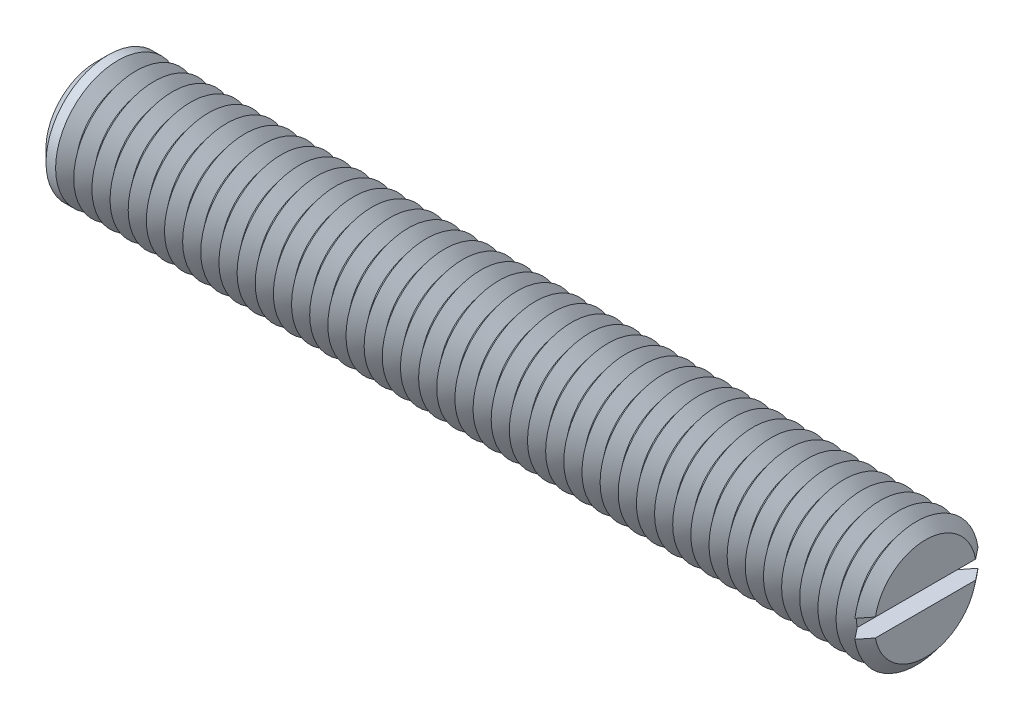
ISO-10303-21;
HEADER;
FILE_DESCRIPTION(('STEP AP214'),'2;1');
FILE_NAME('part.step','',(''),(''),'','','');
FILE_SCHEMA(('AUTOMOTIVE_DESIGN { 1 0 10303 214 1 1 1 1 }'));
ENDSEC;
DATA;
#1=APPLICATION_CONTEXT('core data for automotive mechanical design processes');
#2=APPLICATION_PROTOCOL_DEFINITION('international standard','automotive_design',2000,#1);
#3=PRODUCT_CONTEXT('',#1,'mechanical');
#4=PRODUCT('Part','Part','',(#3));
#5=PRODUCT_RELATED_PRODUCT_CATEGORY('part','',(#4));
#6=PRODUCT_DEFINITION_FORMATION('','',#4);
#7=PRODUCT_DEFINITION_CONTEXT('part definition',#1,'design');
#8=PRODUCT_DEFINITION('design','',#6,#7);
#9=PRODUCT_DEFINITION_SHAPE('','',#8);
#10=(LENGTH_UNIT() NAMED_UNIT(*) SI_UNIT(.MILLI.,.METRE.));
#11=(NAMED_UNIT(*) PLANE_ANGLE_UNIT() SI_UNIT($,.RADIAN.));
#12=(NAMED_UNIT(*) SI_UNIT($,.STERADIAN.) SOLID_ANGLE_UNIT());
#13=UNCERTAINTY_MEASURE_WITH_UNIT(LENGTH_MEASURE(1.E-05),#10,'distance_accuracy_value','');
#14=(GEOMETRIC_REPRESENTATION_CONTEXT(3) GLOBAL_UNCERTAINTY_ASSIGNED_CONTEXT((#13)) GLOBAL_UNIT_ASSIGNED_CONTEXT((#10,
#11,#12)) REPRESENTATION_CONTEXT('',''));
#15=CARTESIAN_POINT('',(0.,0.,0.));
#16=DIRECTION('',(0.,0.,1.));
#17=DIRECTION('',(1.,0.,0.));
#18=AXIS2_PLACEMENT_3D('',#15,#16,#17);
#19=CARTESIAN_POINT('',(39.125,0.,0.));
#20=DIRECTION('',(1.,0.,0.));
#21=DIRECTION('',(0.,0.,-1.));
#22=AXIS2_PLACEMENT_3D('',#19,#20,#21);
#23=CONICAL_SURFACE('',#22,6.,0.895664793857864);
#24=CARTESIAN_POINT('',(39.125,0.,0.));
#25=DIRECTION('',(-1.,0.,0.));
#26=DIRECTION('',(0.,0.,1.));
#27=AXIS2_PLACEMENT_3D('',#24,#25,#26);
#28=CIRCLE('',#27,6.);
#29=CARTESIAN_POINT('',(39.125,-0.875,-5.93585503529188));
#30=VERTEX_POINT('',#29);
#31=CARTESIAN_POINT('',(39.125,-0.874999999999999,5.93585503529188));
#32=VERTEX_POINT('',#31);
#33=EDGE_CURVE('E117',#30,#32,#28,.T.);
#34=ORIENTED_EDGE('',*,*,#33,.T.);
#35=CARTESIAN_POINT('',(44.815666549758,-0.875,-13.0784023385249));
#36=CARTESIAN_POINT('',(44.4425848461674,-0.875,-12.6113718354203));
#37=CARTESIAN_POINT('',(44.0695485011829,-0.875,-12.1443050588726));
#38=CARTESIAN_POINT('',(43.3235952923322,-0.875,-11.2100035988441));
#39=CARTESIAN_POINT('',(42.9506784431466,-0.875,-10.7427689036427));
#40=CARTESIAN_POINT('',(42.2043910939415,-0.875,-9.80728158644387));
#41=CARTESIAN_POINT('',(41.8310209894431,-0.875,-9.33902864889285));
#42=CARTESIAN_POINT('',(41.084654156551,-0.875,-8.40229688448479));
#43=CARTESIAN_POINT('',(40.7116573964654,-0.875,-7.93381808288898));
#44=CARTESIAN_POINT('',(40.1431910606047,-0.875,-7.218940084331));
#45=CARTESIAN_POINT('',(39.9475150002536,-0.875,-6.97270509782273));
#46=CARTESIAN_POINT('',(39.5563780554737,-0.875,-6.4800601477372));
#47=CARTESIAN_POINT('',(39.360917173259,-0.875,-6.23365018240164));
#48=CARTESIAN_POINT('',(38.9702437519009,-0.875,-5.74051596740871));
#49=CARTESIAN_POINT('',(38.7750313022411,-0.875,-5.49379164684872));
#50=CARTESIAN_POINT('',(38.3850627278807,-0.875,-4.99999724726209));
#51=CARTESIAN_POINT('',(38.1903065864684,-0.875,-4.75292718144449));
#52=CARTESIAN_POINT('',(37.8017454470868,-0.875,-4.25854698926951));
#53=CARTESIAN_POINT('',(37.6079395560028,-0.875,-4.01123756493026));
#54=CARTESIAN_POINT('',(37.2214614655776,-0.875,-3.51567639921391));
#55=CARTESIAN_POINT('',(37.0287894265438,-0.875,-3.26742453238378));
#56=CARTESIAN_POINT('',(36.7415141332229,-0.875,-2.89382702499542));
#57=CARTESIAN_POINT('',(36.6460716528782,-0.875,-2.76912721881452));
#58=CARTESIAN_POINT('',(36.4560120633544,-0.875,-2.51908954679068));
#59=CARTESIAN_POINT('',(36.3613949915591,-0.875,-2.39375165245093));
#60=CARTESIAN_POINT('',(36.1734585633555,-0.875,-2.14215479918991));
#61=CARTESIAN_POINT('',(36.0801388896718,-0.875,-2.01589607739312));
#62=CARTESIAN_POINT('',(35.8955738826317,-0.875,-1.7618740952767));
#63=CARTESIAN_POINT('',(35.8043283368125,-0.875,-1.63411099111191));
#64=CARTESIAN_POINT('',(35.6947335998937,-0.875,-1.47575777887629));
#65=CARTESIAN_POINT('',(35.6745750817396,-0.875,-1.44642115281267));
#66=CARTESIAN_POINT('',(35.6344943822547,-0.875,-1.38758643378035));
#67=CARTESIAN_POINT('',(35.6145722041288,-0.875,-1.35808833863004));
#68=CARTESIAN_POINT('',(35.5552118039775,-0.875,-1.26931303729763));
#69=CARTESIAN_POINT('',(35.5161833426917,-0.875,-1.20976002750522));
#70=CARTESIAN_POINT('',(35.439598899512,-0.875,-1.08955604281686));
#71=CARTESIAN_POINT('',(35.4020457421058,-0.875,-1.02890325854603));
#72=CARTESIAN_POINT('',(35.3292052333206,-0.875,-0.906252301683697));
#73=CARTESIAN_POINT('',(35.2939174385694,-0.875,-0.84425439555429));
#74=CARTESIAN_POINT('',(35.2387563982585,-0.875,-0.740802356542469));
#75=CARTESIAN_POINT('',(35.217869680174,-0.875,-0.699896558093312));
#76=CARTESIAN_POINT('',(35.1780353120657,-0.875,-0.617162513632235));
#77=CARTESIAN_POINT('',(35.1590880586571,-0.875,-0.575334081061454));
#78=CARTESIAN_POINT('',(35.106232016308,-0.875,-0.448426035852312));
#79=CARTESIAN_POINT('',(35.0761075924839,-0.875,-0.361569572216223));
#80=CARTESIAN_POINT('',(35.0472166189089,-0.875,-0.240214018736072));
#81=CARTESIAN_POINT('',(35.0406925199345,-0.875,-0.207555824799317));
#82=CARTESIAN_POINT('',(35.0303887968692,-0.875,-0.141816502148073));
#83=CARTESIAN_POINT('',(35.0266076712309,-0.875,-0.108735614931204));
#84=CARTESIAN_POINT('',(35.0220436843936,-0.875,-0.042454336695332));
#85=CARTESIAN_POINT('',(35.0212526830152,-0.875,-0.00925451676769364));
#86=CARTESIAN_POINT('',(35.0227025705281,-0.875,0.0570804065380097));
#87=CARTESIAN_POINT('',(35.0249438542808,-0.875,0.0902155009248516));
#88=CARTESIAN_POINT('',(35.0331880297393,-0.875,0.164063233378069));
#89=CARTESIAN_POINT('',(35.0399634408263,-0.875,0.204689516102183));
#90=CARTESIAN_POINT('',(35.0573167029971,-0.875,0.285126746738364));
#91=CARTESIAN_POINT('',(35.0678973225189,-0.875,0.324937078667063));
#92=CARTESIAN_POINT('',(35.0921930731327,-0.875,0.403898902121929));
#93=CARTESIAN_POINT('',(35.1059311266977,-0.875,0.443043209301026));
#94=CARTESIAN_POINT('',(35.1357974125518,-0.875,0.520385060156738));
#95=CARTESIAN_POINT('',(35.151925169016,-0.875,0.558582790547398));
#96=CARTESIAN_POINT('',(35.2021457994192,-0.875,0.669991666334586));
#97=CARTESIAN_POINT('',(35.2387706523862,-0.875,0.742052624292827));
#98=CARTESIAN_POINT('',(35.316117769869,-0.875,0.883956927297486));
#99=CARTESIAN_POINT('',(35.3568440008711,-0.875,0.95379803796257));
#100=CARTESIAN_POINT('',(35.4409804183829,-0.875,1.0920839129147));
#101=CARTESIAN_POINT('',(35.4843973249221,-0.875,1.16052456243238));
#102=CARTESIAN_POINT('',(35.5729384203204,-0.875,1.29629435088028));
#103=CARTESIAN_POINT('',(35.618062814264,-0.875,1.36362335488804));
#104=CARTESIAN_POINT('',(35.7096565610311,-0.875,1.49772496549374));
#105=CARTESIAN_POINT('',(35.7561302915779,-0.875,1.56449457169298));
#106=CARTESIAN_POINT('',(35.8499281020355,-0.875,1.69744165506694));
#107=CARTESIAN_POINT('',(35.8972522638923,-0.875,1.76361907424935));
#108=CARTESIAN_POINT('',(35.9924358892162,-0.875,1.89539956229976));
#109=CARTESIAN_POINT('',(36.0402941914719,-0.875,1.96100347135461));
#110=CARTESIAN_POINT('',(36.1364816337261,-0.875,2.09186112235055));
#111=CARTESIAN_POINT('',(36.1848107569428,-0.875,2.1571148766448));
#112=CARTESIAN_POINT('',(36.3290907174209,-0.875,2.35079303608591));
#113=CARTESIAN_POINT('',(36.4255659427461,-0.875,2.47882657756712));
#114=CARTESIAN_POINT('',(36.6194152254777,-0.875,2.73421191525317));
#115=CARTESIAN_POINT('',(36.7167892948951,-0.875,2.86156370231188));
#116=CARTESIAN_POINT('',(37.00981832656,-0.875,3.24294102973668));
#117=CARTESIAN_POINT('',(37.2063709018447,-0.875,3.49627631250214));
#118=CARTESIAN_POINT('',(37.6008478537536,-0.875,4.0021902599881));
#119=CARTESIAN_POINT('',(37.7987731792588,-0.875,4.25476818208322));
#120=CARTESIAN_POINT('',(38.1953507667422,-0.875,4.75934213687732));
#121=CARTESIAN_POINT('',(38.394003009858,-0.875,5.01133818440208));
#122=CARTESIAN_POINT('',(38.7908446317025,-0.875,5.51379367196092));
#123=CARTESIAN_POINT('',(38.9890318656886,-0.875,5.76425480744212));
#124=CARTESIAN_POINT('',(39.3857195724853,-0.875,6.26493161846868));
#125=CARTESIAN_POINT('',(39.5842200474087,-0.875,6.51514729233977));
#126=CARTESIAN_POINT('',(40.179949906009,-0.875,7.26541710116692));
#127=CARTESIAN_POINT('',(40.577502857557,-0.875,7.76521426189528));
#128=CARTESIAN_POINT('',(41.2943115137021,-0.875,8.66550309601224));
#129=CARTESIAN_POINT('',(41.6134832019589,-0.875,9.0660617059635));
#130=CARTESIAN_POINT('',(42.2520581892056,-0.875,9.86704239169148));
#131=CARTESIAN_POINT('',(42.5714615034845,-0.875,10.2674644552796));
#132=CARTESIAN_POINT('',(43.2116162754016,-0.875,11.0697025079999));
#133=CARTESIAN_POINT('',(43.5323682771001,-0.875,11.4715180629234));
#134=CARTESIAN_POINT('',(44.1739570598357,-0.875,12.2750327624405));
#135=CARTESIAN_POINT('',(44.4947938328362,-0.875,12.6767319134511));
#136=CARTESIAN_POINT('',(44.815666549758,-0.875,13.0784023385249));
#137=B_SPLINE_CURVE_WITH_KNOTS('',3,(#35,#36,#37,#38,#39,#40,#41,#42,#43,#44,#45,#46,#47,#48,
#49,#50,#51,#52,#53,#54,#55,#56,#57,#58,#59,#60,#61,#62,#63,#64,#65,#66,#67,#68,#69,#70,#71,#72,
#73,#74,#75,#76,#77,#78,#79,#80,#81,#82,#83,#84,#85,#86,#87,#88,#89,#90,#91,#92,#93,#94,#95,#96,
#97,#98,#99,#100,#101,#102,#103,#104,#105,#106,#107,#108,#109,#110,#111,#112,#113,#114,#115,
#116,#117,#118,#119,#120,#121,#122,#123,#124,#125,#126,#127,#128,#129,#130,#131,#132,#133,#134,
#135,#136),.UNSPECIFIED.,.F.,.F.,(4,2,2,2,2,2,2,2,2,2,2,2,2,2,2,2,2,2,2,2,2,2,2,2,2,2,2,2,2,2,2,
2,2,2,2,2,2,2,2,2,2,2,2,2,2,2,2,2,2,2,4),(0.,1.79325603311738,3.58668207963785,5.38334403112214,
7.17983772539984,8.12338791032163,9.06694771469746,10.0107838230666,10.9545848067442,
11.8971886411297,12.8399226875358,13.3110192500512,13.7821370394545,14.2531375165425,
14.72408952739,14.8308734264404,14.9376587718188,15.1512485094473,15.3652290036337,
15.5791674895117,15.7169026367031,15.8546658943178,16.1289739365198,16.2287885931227,
16.3285485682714,16.4280367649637,16.5275379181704,16.6508760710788,16.7743041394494,
16.8986582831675,17.0229876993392,17.2652294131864,17.5077076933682,17.7508180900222,
17.9939577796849,18.2380016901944,18.4820692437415,18.7256822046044,18.9692865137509,
19.4502162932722,19.9311525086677,20.8930708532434,21.8557381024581,22.8183805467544,
23.7765455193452,24.7347169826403,26.6505999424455,28.1871088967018,29.7237307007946,
31.2661438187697,32.8084427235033),.UNSPECIFIED.);
#138=CARTESIAN_POINT('',(38.25,-0.875,4.82848363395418));
#139=VERTEX_POINT('',#138);
#140=EDGE_CURVE('E109',#139,#32,#137,.T.);
#141=ORIENTED_EDGE('',*,*,#140,.F.);
#142=CARTESIAN_POINT('',(38.25,0.,0.));
#143=DIRECTION('',(-1.,0.,0.));
#144=DIRECTION('',(0.,0.,1.));
#145=AXIS2_PLACEMENT_3D('',#142,#143,#144);
#146=CIRCLE('',#145,4.90712535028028);
#147=CARTESIAN_POINT('',(38.25,-0.875,-4.82848363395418));
#148=VERTEX_POINT('',#147);
#149=EDGE_CURVE('E576',#148,#139,#146,.T.);
#150=ORIENTED_EDGE('',*,*,#149,.F.);
#151=EDGE_CURVE('E58',#30,#148,#137,.T.);
#152=ORIENTED_EDGE('',*,*,#151,.F.);
#153=EDGE_LOOP('',(#34,#141,#150,#152));
#154=FACE_BOUND('',#153,.T.);
#155=ADVANCED_FACE('F37',(#154),#23,.T.);
#156=CARTESIAN_POINT('',(39.125,0.874999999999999,5.93585503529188));
#157=VERTEX_POINT('',#156);
#158=CARTESIAN_POINT('',(39.125,0.874999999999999,-5.93585503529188));
#159=VERTEX_POINT('',#158);
#160=EDGE_CURVE('E100',#157,#159,#28,.T.);
#161=ORIENTED_EDGE('',*,*,#160,.T.);
#162=CARTESIAN_POINT('',(44.815666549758,0.875,13.0784023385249));
#163=CARTESIAN_POINT('',(44.4425848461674,0.875,12.6113718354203));
#164=CARTESIAN_POINT('',(44.0695485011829,0.875,12.1443050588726));
#165=CARTESIAN_POINT('',(43.3235952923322,0.875,11.2100035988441));
#166=CARTESIAN_POINT('',(42.9506784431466,0.875,10.7427689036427));
#167=CARTESIAN_POINT('',(42.2043910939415,0.875,9.80728158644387));
#168=CARTESIAN_POINT('',(41.8310209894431,0.875,9.33902864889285));
#169=CARTESIAN_POINT('',(41.084654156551,0.875,8.40229688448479));
#170=CARTESIAN_POINT('',(40.7116573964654,0.875,7.93381808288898));
#171=CARTESIAN_POINT('',(40.1431910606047,0.875,7.218940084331));
#172=CARTESIAN_POINT('',(39.9475150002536,0.875,6.97270509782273));
#173=CARTESIAN_POINT('',(39.5563780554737,0.875,6.4800601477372));
#174=CARTESIAN_POINT('',(39.360917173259,0.875,6.23365018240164));
#175=CARTESIAN_POINT('',(38.9702437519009,0.875,5.74051596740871));
#176=CARTESIAN_POINT('',(38.7750313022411,0.875,5.49379164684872));
#177=CARTESIAN_POINT('',(38.3850627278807,0.875,4.99999724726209));
#178=CARTESIAN_POINT('',(38.1903065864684,0.875,4.75292718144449));
#179=CARTESIAN_POINT('',(37.8017454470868,0.875,4.25854698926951));
#180=CARTESIAN_POINT('',(37.6079395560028,0.875,4.01123756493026));
#181=CARTESIAN_POINT('',(37.2214614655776,0.875,3.51567639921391));
#182=CARTESIAN_POINT('',(37.0287894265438,0.875,3.26742453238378));
#183=CARTESIAN_POINT('',(36.7415141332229,0.875,2.89382702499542));
#184=CARTESIAN_POINT('',(36.6460716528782,0.875,2.76912721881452));
#185=CARTESIAN_POINT('',(36.4560120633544,0.875,2.51908954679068));
#186=CARTESIAN_POINT('',(36.3613949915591,0.875,2.39375165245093));
#187=CARTESIAN_POINT('',(36.1734585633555,0.875,2.14215479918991));
#188=CARTESIAN_POINT('',(36.0801388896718,0.875,2.01589607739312));
#189=CARTESIAN_POINT('',(35.8955738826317,0.875,1.7618740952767));
#190=CARTESIAN_POINT('',(35.8043283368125,0.875,1.63411099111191));
#191=CARTESIAN_POINT('',(35.6947335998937,0.875,1.47575777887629));
#192=CARTESIAN_POINT('',(35.6745750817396,0.875,1.44642115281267));
#193=CARTESIAN_POINT('',(35.6344943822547,0.875,1.38758643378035));
#194=CARTESIAN_POINT('',(35.6145722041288,0.875,1.35808833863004));
#195=CARTESIAN_POINT('',(35.5552118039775,0.875,1.26931303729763));
#196=CARTESIAN_POINT('',(35.5161833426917,0.875,1.20976002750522));
#197=CARTESIAN_POINT('',(35.439598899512,0.875,1.08955604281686));
#198=CARTESIAN_POINT('',(35.4020457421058,0.875,1.02890325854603));
#199=CARTESIAN_POINT('',(35.3292052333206,0.875,0.906252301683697));
#200=CARTESIAN_POINT('',(35.2939174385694,0.875,0.84425439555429));
#201=CARTESIAN_POINT('',(35.2387563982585,0.875,0.740802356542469));
#202=CARTESIAN_POINT('',(35.217869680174,0.875,0.699896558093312));
#203=CARTESIAN_POINT('',(35.1780353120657,0.875,0.617162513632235));
#204=CARTESIAN_POINT('',(35.1590880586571,0.875,0.575334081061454));
#205=CARTESIAN_POINT('',(35.106232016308,0.875,0.448426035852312));
#206=CARTESIAN_POINT('',(35.0761075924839,0.875,0.361569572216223));
#207=CARTESIAN_POINT('',(35.0472166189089,0.875,0.240214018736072));
#208=CARTESIAN_POINT('',(35.0406925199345,0.875,0.207555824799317));
#209=CARTESIAN_POINT('',(35.0303887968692,0.875,0.141816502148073));
#210=CARTESIAN_POINT('',(35.0266076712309,0.875,0.108735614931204));
#211=CARTESIAN_POINT('',(35.0220436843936,0.875,0.042454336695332));
#212=CARTESIAN_POINT('',(35.0212526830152,0.875,0.00925451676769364));
#213=CARTESIAN_POINT('',(35.0227025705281,0.875,-0.0570804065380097));
#214=CARTESIAN_POINT('',(35.0249438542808,0.875,-0.0902155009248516));
#215=CARTESIAN_POINT('',(35.0331880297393,0.875,-0.164063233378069));
#216=CARTESIAN_POINT('',(35.0399634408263,0.875,-0.204689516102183));
#217=CARTESIAN_POINT('',(35.0573167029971,0.875,-0.285126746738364));
#218=CARTESIAN_POINT('',(35.0678973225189,0.875,-0.324937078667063));
#219=CARTESIAN_POINT('',(35.0921930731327,0.875,-0.403898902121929));
#220=CARTESIAN_POINT('',(35.1059311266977,0.875,-0.443043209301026));
#221=CARTESIAN_POINT('',(35.1357974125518,0.875,-0.520385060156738));
#222=CARTESIAN_POINT('',(35.151925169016,0.875,-0.558582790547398));
#223=CARTESIAN_POINT('',(35.2021457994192,0.875,-0.669991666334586));
#224=CARTESIAN_POINT('',(35.2387706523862,0.875,-0.742052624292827));
#225=CARTESIAN_POINT('',(35.316117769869,0.875,-0.883956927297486));
#226=CARTESIAN_POINT('',(35.3568440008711,0.875,-0.95379803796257));
#227=CARTESIAN_POINT('',(35.4409804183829,0.875,-1.0920839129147));
#228=CARTESIAN_POINT('',(35.4843973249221,0.875,-1.16052456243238));
#229=CARTESIAN_POINT('',(35.5729384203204,0.875,-1.29629435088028));
#230=CARTESIAN_POINT('',(35.618062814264,0.875,-1.36362335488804));
#231=CARTESIAN_POINT('',(35.7096565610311,0.875,-1.49772496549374));
#232=CARTESIAN_POINT('',(35.7561302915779,0.875,-1.56449457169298));
#233=CARTESIAN_POINT('',(35.8499281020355,0.875,-1.69744165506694));
#234=CARTESIAN_POINT('',(35.8972522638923,0.875,-1.76361907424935));
#235=CARTESIAN_POINT('',(35.9924358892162,0.875,-1.89539956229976));
#236=CARTESIAN_POINT('',(36.0402941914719,0.875,-1.96100347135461));
#237=CARTESIAN_POINT('',(36.1364816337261,0.875,-2.09186112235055));
#238=CARTESIAN_POINT('',(36.1848107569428,0.875,-2.1571148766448));
#239=CARTESIAN_POINT('',(36.3290907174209,0.875,-2.35079303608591));
#240=CARTESIAN_POINT('',(36.4255659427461,0.875,-2.47882657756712));
#241=CARTESIAN_POINT('',(36.6194152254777,0.875,-2.73421191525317));
#242=CARTESIAN_POINT('',(36.7167892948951,0.875,-2.86156370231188));
#243=CARTESIAN_POINT('',(37.00981832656,0.875,-3.24294102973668));
#244=CARTESIAN_POINT('',(37.2063709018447,0.875,-3.49627631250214));
#245=CARTESIAN_POINT('',(37.6008478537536,0.875,-4.0021902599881));
#246=CARTESIAN_POINT('',(37.7987731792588,0.875,-4.25476818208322));
#247=CARTESIAN_POINT('',(38.1953507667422,0.875,-4.75934213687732));
#248=CARTESIAN_POINT('',(38.394003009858,0.875,-5.01133818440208));
#249=CARTESIAN_POINT('',(38.7908446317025,0.875,-5.51379367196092));
#250=CARTESIAN_POINT('',(38.9890318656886,0.875,-5.76425480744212));
#251=CARTESIAN_POINT('',(39.3857195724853,0.875,-6.26493161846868));
#252=CARTESIAN_POINT('',(39.5842200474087,0.875,-6.51514729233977));
#253=CARTESIAN_POINT('',(40.179949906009,0.875,-7.26541710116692));
#254=CARTESIAN_POINT('',(40.577502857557,0.875,-7.76521426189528));
#255=CARTESIAN_POINT('',(41.2943115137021,0.875,-8.66550309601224));
#256=CARTESIAN_POINT('',(41.6134832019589,0.875,-9.0660617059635));
#257=CARTESIAN_POINT('',(42.2520581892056,0.875,-9.86704239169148));
#258=CARTESIAN_POINT('',(42.5714615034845,0.875,-10.2674644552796));
#259=CARTESIAN_POINT('',(43.2116162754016,0.875,-11.0697025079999));
#260=CARTESIAN_POINT('',(43.5323682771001,0.875,-11.4715180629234));
#261=CARTESIAN_POINT('',(44.1739570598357,0.875,-12.2750327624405));
#262=CARTESIAN_POINT('',(44.4947938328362,0.875,-12.6767319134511));
#263=CARTESIAN_POINT('',(44.815666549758,0.875,-13.0784023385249));
#264=B_SPLINE_CURVE_WITH_KNOTS('',3,(#162,#163,#164,#165,#166,#167,#168,#169,#170,#171,#172,
#173,#174,#175,#176,#177,#178,#179,#180,#181,#182,#183,#184,#185,#186,#187,#188,#189,#190,#191,
#192,#193,#194,#195,#196,#197,#198,#199,#200,#201,#202,#203,#204,#205,#206,#207,#208,#209,#210,
#211,#212,#213,#214,#215,#216,#217,#218,#219,#220,#221,#222,#223,#224,#225,#226,#227,#228,#229,
#230,#231,#232,#233,#234,#235,#236,#237,#238,#239,#240,#241,#242,#243,#244,#245,#246,#247,#248,
#249,#250,#251,#252,#253,#254,#255,#256,#257,#258,#259,#260,#261,#262,#263),.UNSPECIFIED.,.F.,
.F.,(4,2,2,2,2,2,2,2,2,2,2,2,2,2,2,2,2,2,2,2,2,2,2,2,2,2,2,2,2,2,2,2,2,2,2,2,2,2,2,2,2,2,2,2,2,
2,2,2,2,2,4),(0.,1.79325603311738,3.58668207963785,5.38334403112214,7.17983772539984,
8.12338791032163,9.06694771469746,10.0107838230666,10.9545848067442,11.8971886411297,
12.8399226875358,13.3110192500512,13.7821370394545,14.2531375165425,14.72408952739,
14.8308734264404,14.9376587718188,15.1512485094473,15.3652290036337,15.5791674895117,
15.7169026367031,15.8546658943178,16.1289739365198,16.2287885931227,16.3285485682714,
16.4280367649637,16.5275379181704,16.6508760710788,16.7743041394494,16.8986582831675,
17.0229876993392,17.2652294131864,17.5077076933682,17.7508180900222,17.9939577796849,
18.2380016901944,18.4820692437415,18.7256822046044,18.9692865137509,19.4502162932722,
19.9311525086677,20.8930708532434,21.8557381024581,22.8183805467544,23.7765455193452,
24.7347169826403,26.6505999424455,28.1871088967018,29.7237307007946,31.2661438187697,
32.8084427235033),.UNSPECIFIED.);
#265=CARTESIAN_POINT('',(38.25,0.875,-4.82848363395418));
#266=VERTEX_POINT('',#265);
#267=EDGE_CURVE('E110',#266,#159,#264,.T.);
#268=ORIENTED_EDGE('',*,*,#267,.F.);
#269=CARTESIAN_POINT('',(38.25,0.875,4.82848363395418));
#270=VERTEX_POINT('',#269);
#271=EDGE_CURVE('E103',#270,#266,#146,.T.);
#272=ORIENTED_EDGE('',*,*,#271,.F.);
#273=EDGE_CURVE('E97',#157,#270,#264,.T.);
#274=ORIENTED_EDGE('',*,*,#273,.F.);
#275=EDGE_LOOP('',(#161,#268,#272,#274));
#276=FACE_BOUND('',#275,.T.);
#277=ADVANCED_FACE('F99',(#276),#23,.T.);
#278=CARTESIAN_POINT('',(38.25,0.,0.));
#279=DIRECTION('',(-1.,0.,0.));
#280=DIRECTION('',(0.,0.,1.));
#281=AXIS2_PLACEMENT_3D('',#278,#279,#280);
#282=CONICAL_SURFACE('',#281,4.90712535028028,0.895664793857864);
#283=CARTESIAN_POINT('',(37.375,0.,0.));
#284=DIRECTION('',(-1.,0.,0.));
#285=DIRECTION('',(0.,0.,1.));
#286=AXIS2_PLACEMENT_3D('',#283,#284,#285);
#287=CIRCLE('',#286,6.);
#288=CARTESIAN_POINT('',(37.375,0.,6.));
#289=VERTEX_POINT('',#288);
#290=EDGE_CURVE('E562',#289,#289,#287,.T.);
#291=ORIENTED_EDGE('',*,*,#290,.F.);
#292=EDGE_LOOP('',(#291));
#293=FACE_BOUND('',#292,.T.);
#294=ORIENTED_EDGE('',*,*,#271,.T.);
#295=EDGE_CURVE('E570',#266,#148,#146,.T.);
#296=ORIENTED_EDGE('',*,*,#295,.T.);
#297=ORIENTED_EDGE('',*,*,#149,.T.);
#298=EDGE_CURVE('E569',#139,#270,#146,.T.);
#299=ORIENTED_EDGE('',*,*,#298,.T.);
#300=EDGE_LOOP('',(#294,#296,#297,#299));
#301=FACE_BOUND('',#300,.T.);
#302=ADVANCED_FACE('F167',(#293,#301),#282,.T.);
#303=CARTESIAN_POINT('',(40.,0.,0.));
#304=DIRECTION('',(1.,0.,0.));
#305=DIRECTION('',(0.,0.,-1.));
#306=AXIS2_PLACEMENT_3D('',#303,#304,#305);
#307=PLANE('',#306);
#308=CARTESIAN_POINT('',(40.,0.,0.));
#309=DIRECTION('',(-1.,0.,0.));
#310=DIRECTION('',(0.,0.,1.));
#311=AXIS2_PLACEMENT_3D('',#308,#309,#310);
#312=CIRCLE('',#311,4.90712535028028);
#313=CARTESIAN_POINT('',(40.,0.875,4.82848363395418));
#314=VERTEX_POINT('',#313);
#315=CARTESIAN_POINT('',(40.,0.875,-4.82848363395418));
#316=VERTEX_POINT('',#315);
#317=EDGE_CURVE('E159',#314,#316,#312,.T.);
#318=ORIENTED_EDGE('',*,*,#317,.F.);
#319=DIRECTION('',(0.,0.,1.));
#320=VECTOR('',#319,1.);
#321=CARTESIAN_POINT('',(40.,0.875,0.));
#322=LINE('',#321,#320);
#323=EDGE_CURVE('E122',#316,#314,#322,.T.);
#324=ORIENTED_EDGE('',*,*,#323,.F.);
#325=EDGE_LOOP('',(#318,#324));
#326=FACE_BOUND('',#325,.T.);
#327=ADVANCED_FACE('F171',(#326),#307,.T.);
#328=CARTESIAN_POINT('',(40.,-0.875,-4.82848363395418));
#329=VERTEX_POINT('',#328);
#330=CARTESIAN_POINT('',(40.,-0.875,4.82848363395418));
#331=VERTEX_POINT('',#330);
#332=EDGE_CURVE('E66',#329,#331,#312,.T.);
#333=ORIENTED_EDGE('',*,*,#332,.F.);
#334=DIRECTION('',(0.,0.,-1.));
#335=VECTOR('',#334,1.);
#336=CARTESIAN_POINT('',(40.,-0.875,0.));
#337=LINE('',#336,#335);
#338=EDGE_CURVE('E135',#331,#329,#337,.T.);
#339=ORIENTED_EDGE('',*,*,#338,.F.);
#340=EDGE_LOOP('',(#333,#339));
#341=FACE_BOUND('',#340,.T.);
#342=ADVANCED_FACE('F200',(#341),#307,.T.);
#343=CARTESIAN_POINT('',(40.,0.,0.));
#344=DIRECTION('',(-1.,0.,0.));
#345=DIRECTION('',(0.,0.,1.));
#346=AXIS2_PLACEMENT_3D('',#343,#344,#345);
#347=CONICAL_SURFACE('',#346,4.90712535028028,0.895664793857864);
#348=ORIENTED_EDGE('',*,*,#160,.F.);
#349=CARTESIAN_POINT('',(33.434333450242,0.875,-13.0784023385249));
#350=CARTESIAN_POINT('',(33.8074151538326,0.875,-12.6113718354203));
#351=CARTESIAN_POINT('',(34.1804514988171,0.875,-12.1443050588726));
#352=CARTESIAN_POINT('',(34.9264047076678,0.875,-11.2100035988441));
#353=CARTESIAN_POINT('',(35.2993215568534,0.875,-10.7427689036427));
#354=CARTESIAN_POINT('',(36.0456089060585,0.875,-9.80728158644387));
#355=CARTESIAN_POINT('',(36.4189790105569,0.875,-9.33902864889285));
#356=CARTESIAN_POINT('',(37.165345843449,0.875,-8.40229688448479));
#357=CARTESIAN_POINT('',(37.5383426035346,0.875,-7.93381808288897));
#358=CARTESIAN_POINT('',(38.1068089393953,0.875,-7.21894008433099));
#359=CARTESIAN_POINT('',(38.3024849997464,0.875,-6.97270509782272));
#360=CARTESIAN_POINT('',(38.6936219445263,0.875,-6.48006014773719));
#361=CARTESIAN_POINT('',(38.889082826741,0.875,-6.23365018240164));
#362=CARTESIAN_POINT('',(39.2797562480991,0.875,-5.74051596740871));
#363=CARTESIAN_POINT('',(39.4749686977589,0.875,-5.49379164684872));
#364=CARTESIAN_POINT('',(39.8649372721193,0.875,-4.99999724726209));
#365=CARTESIAN_POINT('',(40.0596934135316,0.875,-4.75292718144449));
#366=CARTESIAN_POINT('',(40.4482545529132,0.875,-4.25854698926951));
#367=CARTESIAN_POINT('',(40.6420604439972,0.875,-4.01123756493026));
#368=CARTESIAN_POINT('',(41.0285385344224,0.875,-3.51567639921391));
#369=CARTESIAN_POINT('',(41.2212105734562,0.875,-3.26742453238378));
#370=CARTESIAN_POINT('',(41.5084858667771,0.875,-2.89382702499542));
#371=CARTESIAN_POINT('',(41.6039283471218,0.875,-2.76912721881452));
#372=CARTESIAN_POINT('',(41.7939879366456,0.875,-2.51908954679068));
#373=CARTESIAN_POINT('',(41.8886050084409,0.875,-2.39375165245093));
#374=CARTESIAN_POINT('',(42.0765414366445,0.875,-2.14215479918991));
#375=CARTESIAN_POINT('',(42.1698611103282,0.875,-2.01589607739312));
#376=CARTESIAN_POINT('',(42.3544261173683,0.875,-1.7618740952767));
#377=CARTESIAN_POINT('',(42.4456716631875,0.875,-1.63411099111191));
#378=CARTESIAN_POINT('',(42.5552664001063,0.875,-1.47575777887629));
#379=CARTESIAN_POINT('',(42.5754249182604,0.875,-1.44642115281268));
#380=CARTESIAN_POINT('',(42.6155056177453,0.875,-1.38758643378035));
#381=CARTESIAN_POINT('',(42.6354277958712,0.875,-1.35808833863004));
#382=CARTESIAN_POINT('',(42.6947881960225,0.875,-1.26931303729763));
#383=CARTESIAN_POINT('',(42.7338166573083,0.875,-1.20976002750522));
#384=CARTESIAN_POINT('',(42.810401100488,0.875,-1.08955604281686));
#385=CARTESIAN_POINT('',(42.8479542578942,0.875,-1.02890325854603));
#386=CARTESIAN_POINT('',(42.9207947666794,0.875,-0.906252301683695));
#387=CARTESIAN_POINT('',(42.9560825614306,0.875,-0.84425439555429));
#388=CARTESIAN_POINT('',(43.0112436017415,0.875,-0.74080235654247));
#389=CARTESIAN_POINT('',(43.032130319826,0.875,-0.699896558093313));
#390=CARTESIAN_POINT('',(43.0719646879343,0.875,-0.617162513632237));
#391=CARTESIAN_POINT('',(43.0909119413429,0.875,-0.575334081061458));
#392=CARTESIAN_POINT('',(43.143767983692,0.875,-0.448426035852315));
#393=CARTESIAN_POINT('',(43.1738924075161,0.875,-0.361569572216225));
#394=CARTESIAN_POINT('',(43.2027833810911,0.875,-0.240214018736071));
#395=CARTESIAN_POINT('',(43.2093074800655,0.875,-0.207555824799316));
#396=CARTESIAN_POINT('',(43.2196112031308,0.875,-0.141816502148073));
#397=CARTESIAN_POINT('',(43.2233923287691,0.875,-0.108735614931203));
#398=CARTESIAN_POINT('',(43.2279563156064,0.875,-0.0424543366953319));
#399=CARTESIAN_POINT('',(43.2287473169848,0.875,-0.00925451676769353));
#400=CARTESIAN_POINT('',(43.2272974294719,0.875,0.0570804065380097));
#401=CARTESIAN_POINT('',(43.2250561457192,0.875,0.0902155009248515));
#402=CARTESIAN_POINT('',(43.2168119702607,0.875,0.164063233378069));
#403=CARTESIAN_POINT('',(43.2100365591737,0.875,0.204689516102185));
#404=CARTESIAN_POINT('',(43.1926832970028,0.875,0.285126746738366));
#405=CARTESIAN_POINT('',(43.1821026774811,0.875,0.324937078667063));
#406=CARTESIAN_POINT('',(43.1578069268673,0.875,0.403898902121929));
#407=CARTESIAN_POINT('',(43.1440688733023,0.875,0.443043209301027));
#408=CARTESIAN_POINT('',(43.1142025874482,0.875,0.52038506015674));
#409=CARTESIAN_POINT('',(43.098074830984,0.875,0.558582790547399));
#410=CARTESIAN_POINT('',(43.0478542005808,0.875,0.669991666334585));
#411=CARTESIAN_POINT('',(43.0112293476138,0.875,0.742052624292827));
#412=CARTESIAN_POINT('',(42.933882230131,0.875,0.883956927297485));
#413=CARTESIAN_POINT('',(42.8931559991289,0.875,0.953798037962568));
#414=CARTESIAN_POINT('',(42.8090195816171,0.875,1.0920839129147));
#415=CARTESIAN_POINT('',(42.7656026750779,0.875,1.16052456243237));
#416=CARTESIAN_POINT('',(42.6770615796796,0.875,1.29629435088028));
#417=CARTESIAN_POINT('',(42.631937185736,0.875,1.36362335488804));
#418=CARTESIAN_POINT('',(42.5403434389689,0.875,1.49772496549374));
#419=CARTESIAN_POINT('',(42.4938697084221,0.875,1.56449457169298));
#420=CARTESIAN_POINT('',(42.4000718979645,0.875,1.69744165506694));
#421=CARTESIAN_POINT('',(42.3527477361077,0.875,1.76361907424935));
#422=CARTESIAN_POINT('',(42.2575641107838,0.875,1.89539956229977));
#423=CARTESIAN_POINT('',(42.2097058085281,0.875,1.96100347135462));
#424=CARTESIAN_POINT('',(42.1135183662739,0.875,2.09186112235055));
#425=CARTESIAN_POINT('',(42.0651892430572,0.875,2.1571148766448));
#426=CARTESIAN_POINT('',(41.9209092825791,0.875,2.35079303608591));
#427=CARTESIAN_POINT('',(41.8244340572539,0.875,2.47882657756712));
#428=CARTESIAN_POINT('',(41.6305847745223,0.875,2.73421191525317));
#429=CARTESIAN_POINT('',(41.5332107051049,0.875,2.86156370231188));
#430=CARTESIAN_POINT('',(41.24018167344,0.875,3.24294102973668));
#431=CARTESIAN_POINT('',(41.0436290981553,0.875,3.49627631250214));
#432=CARTESIAN_POINT('',(40.6491521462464,0.875,4.0021902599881));
#433=CARTESIAN_POINT('',(40.4512268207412,0.875,4.25476818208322));
#434=CARTESIAN_POINT('',(40.0546492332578,0.875,4.75934213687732));
#435=CARTESIAN_POINT('',(39.855996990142,0.875,5.01133818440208));
#436=CARTESIAN_POINT('',(39.4591553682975,0.875,5.51379367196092));
#437=CARTESIAN_POINT('',(39.2609681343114,0.875,5.76425480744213));
#438=CARTESIAN_POINT('',(38.8642804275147,0.875,6.26493161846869));
#439=CARTESIAN_POINT('',(38.6657799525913,0.875,6.51514729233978));
#440=CARTESIAN_POINT('',(38.070050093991,0.875,7.26541710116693));
#441=CARTESIAN_POINT('',(37.672497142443,0.875,7.76521426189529));
#442=CARTESIAN_POINT('',(36.9556884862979,0.875,8.66550309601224));
#443=CARTESIAN_POINT('',(36.6365167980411,0.875,9.0660617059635));
#444=CARTESIAN_POINT('',(35.9979418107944,0.875,9.86704239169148));
#445=CARTESIAN_POINT('',(35.6785384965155,0.875,10.2674644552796));
#446=CARTESIAN_POINT('',(35.0383837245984,0.875,11.0697025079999));
#447=CARTESIAN_POINT('',(34.7176317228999,0.875,11.4715180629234));
#448=CARTESIAN_POINT('',(34.0760429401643,0.875,12.2750327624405));
#449=CARTESIAN_POINT('',(33.7552061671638,0.875,12.6767319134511));
#450=CARTESIAN_POINT('',(33.434333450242,0.875,13.0784023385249));
#451=B_SPLINE_CURVE_WITH_KNOTS('',3,(#349,#350,#351,#352,#353,#354,#355,#356,#357,#358,#359,
#360,#361,#362,#363,#364,#365,#366,#367,#368,#369,#370,#371,#372,#373,#374,#375,#376,#377,#378,
#379,#380,#381,#382,#383,#384,#385,#386,#387,#388,#389,#390,#391,#392,#393,#394,#395,#396,#397,
#398,#399,#400,#401,#402,#403,#404,#405,#406,#407,#408,#409,#410,#411,#412,#413,#414,#415,#416,
#417,#418,#419,#420,#421,#422,#423,#424,#425,#426,#427,#428,#429,#430,#431,#432,#433,#434,#435,
#436,#437,#438,#439,#440,#441,#442,#443,#444,#445,#446,#447,#448,#449,#450),.UNSPECIFIED.,.F.,
.F.,(4,2,2,2,2,2,2,2,2,2,2,2,2,2,2,2,2,2,2,2,2,2,2,2,2,2,2,2,2,2,2,2,2,2,2,2,2,2,2,2,2,2,2,2,2,
2,2,2,2,2,4),(0.,1.79325603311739,3.58668207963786,5.38334403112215,7.17983772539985,
8.12338791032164,9.06694771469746,10.0107838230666,10.9545848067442,11.8971886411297,
12.8399226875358,13.3110192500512,13.7821370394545,14.2531375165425,14.72408952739,
14.8308734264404,14.9376587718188,15.1512485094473,15.3652290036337,15.5791674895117,
15.7169026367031,15.8546658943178,16.1289739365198,16.2287885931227,16.3285485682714,
16.4280367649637,16.5275379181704,16.6508760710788,16.7743041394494,16.8986582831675,
17.0229876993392,17.2652294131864,17.5077076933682,17.7508180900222,17.9939577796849,
18.2380016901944,18.4820692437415,18.7256822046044,18.9692865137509,19.4502162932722,
19.9311525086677,20.8930708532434,21.8557381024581,22.8183805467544,23.7765455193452,
24.7347169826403,26.6505999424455,28.1871088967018,29.7237307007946,31.2661438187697,
32.8084427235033),.UNSPECIFIED.);
#452=EDGE_CURVE('E41',#314,#157,#451,.T.);
#453=ORIENTED_EDGE('',*,*,#452,.F.);
#454=ORIENTED_EDGE('',*,*,#317,.T.);
#455=EDGE_CURVE('E11',#159,#316,#451,.T.);
#456=ORIENTED_EDGE('',*,*,#455,.F.);
#457=EDGE_LOOP('',(#348,#453,#454,#456));
#458=FACE_BOUND('',#457,.T.);
#459=ADVANCED_FACE('F114',(#458),#347,.T.);
#460=CARTESIAN_POINT('',(40.,0.875,-9.));
#461=DIRECTION('',(0.,1.,0.));
#462=DIRECTION('',(0.,0.,1.));
#463=AXIS2_PLACEMENT_3D('',#460,#461,#462);
#464=PLANE('',#463);
#465=ORIENTED_EDGE('',*,*,#452,.T.);
#466=ORIENTED_EDGE('',*,*,#273,.T.);
#467=DIRECTION('',(0.,0.,1.));
#468=VECTOR('',#467,1.);
#469=CARTESIAN_POINT('',(38.25,0.875,-9.));
#470=LINE('',#469,#468);
#471=EDGE_CURVE('E144',#266,#270,#470,.T.);
#472=ORIENTED_EDGE('',*,*,#471,.F.);
#473=ORIENTED_EDGE('',*,*,#267,.T.);
#474=ORIENTED_EDGE('',*,*,#455,.T.);
#475=ORIENTED_EDGE('',*,*,#323,.T.);
#476=EDGE_LOOP('',(#465,#466,#472,#473,#474,#475));
#477=FACE_BOUND('',#476,.T.);
#478=ADVANCED_FACE('F120',(#477),#464,.F.);
#479=ORIENTED_EDGE('',*,*,#33,.F.);
#480=CARTESIAN_POINT('',(33.434333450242,-0.875,13.0784023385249));
#481=CARTESIAN_POINT('',(33.8074151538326,-0.875,12.6113718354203));
#482=CARTESIAN_POINT('',(34.1804514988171,-0.875,12.1443050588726));
#483=CARTESIAN_POINT('',(34.9264047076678,-0.875,11.2100035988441));
#484=CARTESIAN_POINT('',(35.2993215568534,-0.875,10.7427689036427));
#485=CARTESIAN_POINT('',(36.0456089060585,-0.875,9.80728158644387));
#486=CARTESIAN_POINT('',(36.4189790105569,-0.875,9.33902864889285));
#487=CARTESIAN_POINT('',(37.165345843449,-0.875,8.40229688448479));
#488=CARTESIAN_POINT('',(37.5383426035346,-0.875,7.93381808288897));
#489=CARTESIAN_POINT('',(38.1068089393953,-0.875,7.21894008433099));
#490=CARTESIAN_POINT('',(38.3024849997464,-0.875,6.97270509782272));
#491=CARTESIAN_POINT('',(38.6936219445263,-0.875,6.48006014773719));
#492=CARTESIAN_POINT('',(38.889082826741,-0.875,6.23365018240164));
#493=CARTESIAN_POINT('',(39.2797562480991,-0.875,5.74051596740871));
#494=CARTESIAN_POINT('',(39.4749686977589,-0.875,5.49379164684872));
#495=CARTESIAN_POINT('',(39.8649372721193,-0.875,4.99999724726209));
#496=CARTESIAN_POINT('',(40.0596934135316,-0.875,4.75292718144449));
#497=CARTESIAN_POINT('',(40.4482545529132,-0.875,4.25854698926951));
#498=CARTESIAN_POINT('',(40.6420604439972,-0.875,4.01123756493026));
#499=CARTESIAN_POINT('',(41.0285385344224,-0.875,3.51567639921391));
#500=CARTESIAN_POINT('',(41.2212105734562,-0.875,3.26742453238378));
#501=CARTESIAN_POINT('',(41.5084858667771,-0.875,2.89382702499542));
#502=CARTESIAN_POINT('',(41.6039283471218,-0.875,2.76912721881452));
#503=CARTESIAN_POINT('',(41.7939879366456,-0.875,2.51908954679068));
#504=CARTESIAN_POINT('',(41.8886050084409,-0.875,2.39375165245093));
#505=CARTESIAN_POINT('',(42.0765414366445,-0.875,2.14215479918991));
#506=CARTESIAN_POINT('',(42.1698611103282,-0.875,2.01589607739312));
#507=CARTESIAN_POINT('',(42.3544261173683,-0.875,1.7618740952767));
#508=CARTESIAN_POINT('',(42.4456716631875,-0.875,1.63411099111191));
#509=CARTESIAN_POINT('',(42.5552664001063,-0.875,1.47575777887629));
#510=CARTESIAN_POINT('',(42.5754249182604,-0.875,1.44642115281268));
#511=CARTESIAN_POINT('',(42.6155056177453,-0.875,1.38758643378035));
#512=CARTESIAN_POINT('',(42.6354277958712,-0.875,1.35808833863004));
#513=CARTESIAN_POINT('',(42.6947881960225,-0.875,1.26931303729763));
#514=CARTESIAN_POINT('',(42.7338166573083,-0.875,1.20976002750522));
#515=CARTESIAN_POINT('',(42.810401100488,-0.875,1.08955604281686));
#516=CARTESIAN_POINT('',(42.8479542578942,-0.875,1.02890325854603));
#517=CARTESIAN_POINT('',(42.9207947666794,-0.875,0.906252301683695));
#518=CARTESIAN_POINT('',(42.9560825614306,-0.875,0.84425439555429));
#519=CARTESIAN_POINT('',(43.0112436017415,-0.875,0.74080235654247));
#520=CARTESIAN_POINT('',(43.032130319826,-0.875,0.699896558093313));
#521=CARTESIAN_POINT('',(43.0719646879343,-0.875,0.617162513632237));
#522=CARTESIAN_POINT('',(43.0909119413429,-0.875,0.575334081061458));
#523=CARTESIAN_POINT('',(43.143767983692,-0.875,0.448426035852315));
#524=CARTESIAN_POINT('',(43.1738924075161,-0.875,0.361569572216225));
#525=CARTESIAN_POINT('',(43.2027833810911,-0.875,0.240214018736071));
#526=CARTESIAN_POINT('',(43.2093074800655,-0.875,0.207555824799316));
#527=CARTESIAN_POINT('',(43.2196112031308,-0.875,0.141816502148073));
#528=CARTESIAN_POINT('',(43.2233923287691,-0.875,0.108735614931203));
#529=CARTESIAN_POINT('',(43.2279563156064,-0.875,0.0424543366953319));
#530=CARTESIAN_POINT('',(43.2287473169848,-0.875,0.00925451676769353));
#531=CARTESIAN_POINT('',(43.2272974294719,-0.875,-0.0570804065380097));
#532=CARTESIAN_POINT('',(43.2250561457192,-0.875,-0.0902155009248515));
#533=CARTESIAN_POINT('',(43.2168119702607,-0.875,-0.164063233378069));
#534=CARTESIAN_POINT('',(43.2100365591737,-0.875,-0.204689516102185));
#535=CARTESIAN_POINT('',(43.1926832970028,-0.875,-0.285126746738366));
#536=CARTESIAN_POINT('',(43.1821026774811,-0.875,-0.324937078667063));
#537=CARTESIAN_POINT('',(43.1578069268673,-0.875,-0.403898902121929));
#538=CARTESIAN_POINT('',(43.1440688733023,-0.875,-0.443043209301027));
#539=CARTESIAN_POINT('',(43.1142025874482,-0.875,-0.52038506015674));
#540=CARTESIAN_POINT('',(43.098074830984,-0.875,-0.558582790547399));
#541=CARTESIAN_POINT('',(43.0478542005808,-0.875,-0.669991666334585));
#542=CARTESIAN_POINT('',(43.0112293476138,-0.875,-0.742052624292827));
#543=CARTESIAN_POINT('',(42.933882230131,-0.875,-0.883956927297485));
#544=CARTESIAN_POINT('',(42.8931559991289,-0.875,-0.953798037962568));
#545=CARTESIAN_POINT('',(42.8090195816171,-0.875,-1.0920839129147));
#546=CARTESIAN_POINT('',(42.7656026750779,-0.875,-1.16052456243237));
#547=CARTESIAN_POINT('',(42.6770615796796,-0.875,-1.29629435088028));
#548=CARTESIAN_POINT('',(42.631937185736,-0.875,-1.36362335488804));
#549=CARTESIAN_POINT('',(42.5403434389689,-0.875,-1.49772496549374));
#550=CARTESIAN_POINT('',(42.4938697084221,-0.875,-1.56449457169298));
#551=CARTESIAN_POINT('',(42.4000718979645,-0.875,-1.69744165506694));
#552=CARTESIAN_POINT('',(42.3527477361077,-0.875,-1.76361907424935));
#553=CARTESIAN_POINT('',(42.2575641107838,-0.875,-1.89539956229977));
#554=CARTESIAN_POINT('',(42.2097058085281,-0.875,-1.96100347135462));
#555=CARTESIAN_POINT('',(42.1135183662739,-0.875,-2.09186112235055));
#556=CARTESIAN_POINT('',(42.0651892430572,-0.875,-2.1571148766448));
#557=CARTESIAN_POINT('',(41.9209092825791,-0.875,-2.35079303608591));
#558=CARTESIAN_POINT('',(41.8244340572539,-0.875,-2.47882657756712));
#559=CARTESIAN_POINT('',(41.6305847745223,-0.875,-2.73421191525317));
#560=CARTESIAN_POINT('',(41.5332107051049,-0.875,-2.86156370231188));
#561=CARTESIAN_POINT('',(41.24018167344,-0.875,-3.24294102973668));
#562=CARTESIAN_POINT('',(41.0436290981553,-0.875,-3.49627631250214));
#563=CARTESIAN_POINT('',(40.6491521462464,-0.875,-4.0021902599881));
#564=CARTESIAN_POINT('',(40.4512268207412,-0.875,-4.25476818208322));
#565=CARTESIAN_POINT('',(40.0546492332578,-0.875,-4.75934213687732));
#566=CARTESIAN_POINT('',(39.855996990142,-0.875,-5.01133818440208));
#567=CARTESIAN_POINT('',(39.4591553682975,-0.875,-5.51379367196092));
#568=CARTESIAN_POINT('',(39.2609681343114,-0.875,-5.76425480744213));
#569=CARTESIAN_POINT('',(38.8642804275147,-0.875,-6.26493161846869));
#570=CARTESIAN_POINT('',(38.6657799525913,-0.875,-6.51514729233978));
#571=CARTESIAN_POINT('',(38.070050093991,-0.875,-7.26541710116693));
#572=CARTESIAN_POINT('',(37.672497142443,-0.875,-7.76521426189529));
#573=CARTESIAN_POINT('',(36.9556884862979,-0.875,-8.66550309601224));
#574=CARTESIAN_POINT('',(36.6365167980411,-0.875,-9.0660617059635));
#575=CARTESIAN_POINT('',(35.9979418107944,-0.875,-9.86704239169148));
#576=CARTESIAN_POINT('',(35.6785384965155,-0.875,-10.2674644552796));
#577=CARTESIAN_POINT('',(35.0383837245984,-0.875,-11.0697025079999));
#578=CARTESIAN_POINT('',(34.7176317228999,-0.875,-11.4715180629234));
#579=CARTESIAN_POINT('',(34.0760429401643,-0.875,-12.2750327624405));
#580=CARTESIAN_POINT('',(33.7552061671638,-0.875,-12.6767319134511));
#581=CARTESIAN_POINT('',(33.434333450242,-0.875,-13.0784023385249));
#582=B_SPLINE_CURVE_WITH_KNOTS('',3,(#480,#481,#482,#483,#484,#485,#486,#487,#488,#489,#490,
#491,#492,#493,#494,#495,#496,#497,#498,#499,#500,#501,#502,#503,#504,#505,#506,#507,#508,#509,
#510,#511,#512,#513,#514,#515,#516,#517,#518,#519,#520,#521,#522,#523,#524,#525,#526,#527,#528,
#529,#530,#531,#532,#533,#534,#535,#536,#537,#538,#539,#540,#541,#542,#543,#544,#545,#546,#547,
#548,#549,#550,#551,#552,#553,#554,#555,#556,#557,#558,#559,#560,#561,#562,#563,#564,#565,#566,
#567,#568,#569,#570,#571,#572,#573,#574,#575,#576,#577,#578,#579,#580,#581),.UNSPECIFIED.,.F.,
.F.,(4,2,2,2,2,2,2,2,2,2,2,2,2,2,2,2,2,2,2,2,2,2,2,2,2,2,2,2,2,2,2,2,2,2,2,2,2,2,2,2,2,2,2,2,2,
2,2,2,2,2,4),(0.,1.79325603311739,3.58668207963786,5.38334403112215,7.17983772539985,
8.12338791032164,9.06694771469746,10.0107838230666,10.9545848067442,11.8971886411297,
12.8399226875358,13.3110192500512,13.7821370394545,14.2531375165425,14.72408952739,
14.8308734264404,14.9376587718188,15.1512485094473,15.3652290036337,15.5791674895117,
15.7169026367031,15.8546658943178,16.1289739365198,16.2287885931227,16.3285485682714,
16.4280367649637,16.5275379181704,16.6508760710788,16.7743041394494,16.8986582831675,
17.0229876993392,17.2652294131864,17.5077076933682,17.7508180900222,17.9939577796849,
18.2380016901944,18.4820692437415,18.7256822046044,18.9692865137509,19.4502162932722,
19.9311525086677,20.8930708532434,21.8557381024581,22.8183805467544,23.7765455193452,
24.7347169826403,26.6505999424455,28.1871088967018,29.7237307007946,31.2661438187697,
32.8084427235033),.UNSPECIFIED.);
#583=EDGE_CURVE('E151',#329,#30,#582,.T.);
#584=ORIENTED_EDGE('',*,*,#583,.F.);
#585=ORIENTED_EDGE('',*,*,#332,.T.);
#586=EDGE_CURVE('E147',#32,#331,#582,.T.);
#587=ORIENTED_EDGE('',*,*,#586,.F.);
#588=EDGE_LOOP('',(#479,#584,#585,#587));
#589=FACE_BOUND('',#588,.T.);
#590=ADVANCED_FACE('F163',(#589),#347,.T.);
#591=CARTESIAN_POINT('',(40.,-0.875,-9.));
#592=DIRECTION('',(0.,-1.,0.));
#593=DIRECTION('',(0.,0.,-1.));
#594=AXIS2_PLACEMENT_3D('',#591,#592,#593);
#595=PLANE('',#594);
#596=ORIENTED_EDGE('',*,*,#583,.T.);
#597=ORIENTED_EDGE('',*,*,#151,.T.);
#598=DIRECTION('',(0.,0.,1.));
#599=VECTOR('',#598,1.);
#600=CARTESIAN_POINT('',(38.25,-0.875,-9.));
#601=LINE('',#600,#599);
#602=EDGE_CURVE('E143',#148,#139,#601,.T.);
#603=ORIENTED_EDGE('',*,*,#602,.T.);
#604=ORIENTED_EDGE('',*,*,#140,.T.);
#605=ORIENTED_EDGE('',*,*,#586,.T.);
#606=ORIENTED_EDGE('',*,*,#338,.T.);
#607=EDGE_LOOP('',(#596,#597,#603,#604,#605,#606));
#608=FACE_BOUND('',#607,.T.);
#609=ADVANCED_FACE('F160',(#608),#595,.F.);
#610=CARTESIAN_POINT('',(38.25,0.875,-9.));
#611=DIRECTION('',(-1.,0.,0.));
#612=DIRECTION('',(0.,0.,1.));
#613=AXIS2_PLACEMENT_3D('',#610,#611,#612);
#614=PLANE('',#613);
#615=ORIENTED_EDGE('',*,*,#602,.F.);
#616=ORIENTED_EDGE('',*,*,#295,.F.);
#617=ORIENTED_EDGE('',*,*,#471,.T.);
#618=ORIENTED_EDGE('',*,*,#298,.F.);
#619=EDGE_LOOP('',(#615,#616,#617,#618));
#620=FACE_BOUND('',#619,.T.);
#621=ADVANCED_FACE('F581',(#620),#614,.F.);
#622=CARTESIAN_POINT('',(36.5,0.,0.));
#623=DIRECTION('',(-1.,0.,0.));
#624=DIRECTION('',(0.,0.,1.));
#625=AXIS2_PLACEMENT_3D('',#622,#623,#624);
#626=CONICAL_SURFACE('',#625,4.90712535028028,0.895664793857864);
#627=CARTESIAN_POINT('',(35.625,0.,0.));
#628=DIRECTION('',(-1.,0.,0.));
#629=DIRECTION('',(0.,0.,1.));
#630=AXIS2_PLACEMENT_3D('',#627,#628,#629);
#631=CIRCLE('',#630,6.);
#632=CARTESIAN_POINT('',(35.625,0.,6.));
#633=VERTEX_POINT('',#632);
#634=EDGE_CURVE('E554',#633,#633,#631,.T.);
#635=ORIENTED_EDGE('',*,*,#634,.F.);
#636=EDGE_LOOP('',(#635));
#637=FACE_BOUND('',#636,.T.);
#638=CARTESIAN_POINT('',(36.5,0.,0.));
#639=DIRECTION('',(-1.,0.,0.));
#640=DIRECTION('',(0.,0.,1.));
#641=AXIS2_PLACEMENT_3D('',#638,#639,#640);
#642=CIRCLE('',#641,4.90712535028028);
#643=CARTESIAN_POINT('',(36.5,0.,4.90712535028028));
#644=VERTEX_POINT('',#643);
#645=EDGE_CURVE('E566',#644,#644,#642,.T.);
#646=ORIENTED_EDGE('',*,*,#645,.T.);
#647=EDGE_LOOP('',(#646));
#648=FACE_BOUND('',#647,.T.);
#649=ADVANCED_FACE('F176',(#637,#648),#626,.T.);
#650=CARTESIAN_POINT('',(37.375,0.,0.));
#651=DIRECTION('',(1.,0.,0.));
#652=DIRECTION('',(0.,0.,-1.));
#653=AXIS2_PLACEMENT_3D('',#650,#651,#652);
#654=CONICAL_SURFACE('',#653,6.,0.895664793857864);
#655=ORIENTED_EDGE('',*,*,#645,.F.);
#656=EDGE_LOOP('',(#655));
#657=FACE_BOUND('',#656,.T.);
#658=ORIENTED_EDGE('',*,*,#290,.T.);
#659=EDGE_LOOP('',(#658));
#660=FACE_BOUND('',#659,.T.);
#661=ADVANCED_FACE('F587',(#657,#660),#654,.T.);
#662=CARTESIAN_POINT('',(34.75,0.,0.));
#663=DIRECTION('',(-1.,0.,0.));
#664=DIRECTION('',(0.,0.,1.));
#665=AXIS2_PLACEMENT_3D('',#662,#663,#664);
#666=CONICAL_SURFACE('',#665,4.90712535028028,0.895664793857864);
#667=CARTESIAN_POINT('',(33.875,0.,0.));
#668=DIRECTION('',(-1.,0.,0.));
#669=DIRECTION('',(0.,0.,1.));
#670=AXIS2_PLACEMENT_3D('',#667,#668,#669);
#671=CIRCLE('',#670,6.);
#672=CARTESIAN_POINT('',(33.875,0.,6.));
#673=VERTEX_POINT('',#672);
#674=EDGE_CURVE('E546',#673,#673,#671,.T.);
#675=ORIENTED_EDGE('',*,*,#674,.F.);
#676=EDGE_LOOP('',(#675));
#677=FACE_BOUND('',#676,.T.);
#678=CARTESIAN_POINT('',(34.75,0.,0.));
#679=DIRECTION('',(-1.,0.,0.));
#680=DIRECTION('',(0.,0.,1.));
#681=AXIS2_PLACEMENT_3D('',#678,#679,#680);
#682=CIRCLE('',#681,4.90712535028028);
#683=CARTESIAN_POINT('',(34.75,0.,4.90712535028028));
#684=VERTEX_POINT('',#683);
#685=EDGE_CURVE('E558',#684,#684,#682,.T.);
#686=ORIENTED_EDGE('',*,*,#685,.T.);
#687=EDGE_LOOP('',(#686));
#688=FACE_BOUND('',#687,.T.);
#689=ADVANCED_FACE('F651',(#677,#688),#666,.T.);
#690=CARTESIAN_POINT('',(35.625,0.,0.));
#691=DIRECTION('',(1.,0.,0.));
#692=DIRECTION('',(0.,0.,-1.));
#693=AXIS2_PLACEMENT_3D('',#690,#691,#692);
#694=CONICAL_SURFACE('',#693,6.,0.895664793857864);
#695=ORIENTED_EDGE('',*,*,#685,.F.);
#696=EDGE_LOOP('',(#695));
#697=FACE_BOUND('',#696,.T.);
#698=ORIENTED_EDGE('',*,*,#634,.T.);
#699=EDGE_LOOP('',(#698));
#700=FACE_BOUND('',#699,.T.);
#701=ADVANCED_FACE('F660',(#697,#700),#694,.T.);
#702=CARTESIAN_POINT('',(33.,0.,0.));
#703=DIRECTION('',(-1.,0.,0.));
#704=DIRECTION('',(0.,0.,1.));
#705=AXIS2_PLACEMENT_3D('',#702,#703,#704);
#706=CONICAL_SURFACE('',#705,4.90712535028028,0.895664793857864);
#707=CARTESIAN_POINT('',(32.125,0.,0.));
#708=DIRECTION('',(-1.,0.,0.));
#709=DIRECTION('',(0.,0.,1.));
#710=AXIS2_PLACEMENT_3D('',#707,#708,#709);
#711=CIRCLE('',#710,6.);
#712=CARTESIAN_POINT('',(32.125,0.,6.));
#713=VERTEX_POINT('',#712);
#714=EDGE_CURVE('E538',#713,#713,#711,.T.);
#715=ORIENTED_EDGE('',*,*,#714,.F.);
#716=EDGE_LOOP('',(#715));
#717=FACE_BOUND('',#716,.T.);
#718=CARTESIAN_POINT('',(33.,0.,0.));
#719=DIRECTION('',(-1.,0.,0.));
#720=DIRECTION('',(0.,0.,1.));
#721=AXIS2_PLACEMENT_3D('',#718,#719,#720);
#722=CIRCLE('',#721,4.90712535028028);
#723=CARTESIAN_POINT('',(33.,0.,4.90712535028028));
#724=VERTEX_POINT('',#723);
#725=EDGE_CURVE('E550',#724,#724,#722,.T.);
#726=ORIENTED_EDGE('',*,*,#725,.T.);
#727=EDGE_LOOP('',(#726));
#728=FACE_BOUND('',#727,.T.);
#729=ADVANCED_FACE('F670',(#717,#728),#706,.T.);
#730=CARTESIAN_POINT('',(33.875,0.,0.));
#731=DIRECTION('',(1.,0.,0.));
#732=DIRECTION('',(0.,0.,-1.));
#733=AXIS2_PLACEMENT_3D('',#730,#731,#732);
#734=CONICAL_SURFACE('',#733,6.,0.895664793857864);
#735=ORIENTED_EDGE('',*,*,#725,.F.);
#736=EDGE_LOOP('',(#735));
#737=FACE_BOUND('',#736,.T.);
#738=ORIENTED_EDGE('',*,*,#674,.T.);
#739=EDGE_LOOP('',(#738));
#740=FACE_BOUND('',#739,.T.);
#741=ADVANCED_FACE('F680',(#737,#740),#734,.T.);
#742=CARTESIAN_POINT('',(31.25,0.,0.));
#743=DIRECTION('',(-1.,0.,0.));
#744=DIRECTION('',(0.,0.,1.));
#745=AXIS2_PLACEMENT_3D('',#742,#743,#744);
#746=CONICAL_SURFACE('',#745,4.90712535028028,0.895664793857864);
#747=CARTESIAN_POINT('',(30.375,0.,0.));
#748=DIRECTION('',(-1.,0.,0.));
#749=DIRECTION('',(0.,0.,1.));
#750=AXIS2_PLACEMENT_3D('',#747,#748,#749);
#751=CIRCLE('',#750,6.);
#752=CARTESIAN_POINT('',(30.375,0.,6.));
#753=VERTEX_POINT('',#752);
#754=EDGE_CURVE('E531',#753,#753,#751,.T.);
#755=ORIENTED_EDGE('',*,*,#754,.F.);
#756=EDGE_LOOP('',(#755));
#757=FACE_BOUND('',#756,.T.);
#758=CARTESIAN_POINT('',(31.25,0.,0.));
#759=DIRECTION('',(-1.,0.,0.));
#760=DIRECTION('',(0.,0.,1.));
#761=AXIS2_PLACEMENT_3D('',#758,#759,#760);
#762=CIRCLE('',#761,4.90712535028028);
#763=CARTESIAN_POINT('',(31.25,0.,4.90712535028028));
#764=VERTEX_POINT('',#763);
#765=EDGE_CURVE('E542',#764,#764,#762,.T.);
#766=ORIENTED_EDGE('',*,*,#765,.T.);
#767=EDGE_LOOP('',(#766));
#768=FACE_BOUND('',#767,.T.);
#769=ADVANCED_FACE('F690',(#757,#768),#746,.T.);
#770=CARTESIAN_POINT('',(32.125,0.,0.));
#771=DIRECTION('',(1.,0.,0.));
#772=DIRECTION('',(0.,0.,-1.));
#773=AXIS2_PLACEMENT_3D('',#770,#771,#772);
#774=CONICAL_SURFACE('',#773,6.,0.895664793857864);
#775=ORIENTED_EDGE('',*,*,#765,.F.);
#776=EDGE_LOOP('',(#775));
#777=FACE_BOUND('',#776,.T.);
#778=ORIENTED_EDGE('',*,*,#714,.T.);
#779=EDGE_LOOP('',(#778));
#780=FACE_BOUND('',#779,.T.);
#781=ADVANCED_FACE('F700',(#777,#780),#774,.T.);
#782=CARTESIAN_POINT('',(29.5,0.,0.));
#783=DIRECTION('',(-1.,0.,0.));
#784=DIRECTION('',(0.,0.,1.));
#785=AXIS2_PLACEMENT_3D('',#782,#783,#784);
#786=CONICAL_SURFACE('',#785,4.90712535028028,0.895664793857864);
#787=CARTESIAN_POINT('',(28.625,0.,0.));
#788=DIRECTION('',(-1.,0.,0.));
#789=DIRECTION('',(0.,0.,1.));
#790=AXIS2_PLACEMENT_3D('',#787,#788,#789);
#791=CIRCLE('',#790,6.);
#792=CARTESIAN_POINT('',(28.625,0.,6.));
#793=VERTEX_POINT('',#792);
#794=EDGE_CURVE('E523',#793,#793,#791,.T.);
#795=ORIENTED_EDGE('',*,*,#794,.F.);
#796=EDGE_LOOP('',(#795));
#797=FACE_BOUND('',#796,.T.);
#798=CARTESIAN_POINT('',(29.5,0.,0.));
#799=DIRECTION('',(-1.,0.,0.));
#800=DIRECTION('',(0.,0.,1.));
#801=AXIS2_PLACEMENT_3D('',#798,#799,#800);
#802=CIRCLE('',#801,4.90712535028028);
#803=CARTESIAN_POINT('',(29.5,0.,4.90712535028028));
#804=VERTEX_POINT('',#803);
#805=EDGE_CURVE('E535',#804,#804,#802,.T.);
#806=ORIENTED_EDGE('',*,*,#805,.T.);
#807=EDGE_LOOP('',(#806));
#808=FACE_BOUND('',#807,.T.);
#809=ADVANCED_FACE('F710',(#797,#808),#786,.T.);
#810=CARTESIAN_POINT('',(30.375,0.,0.));
#811=DIRECTION('',(1.,0.,0.));
#812=DIRECTION('',(0.,0.,-1.));
#813=AXIS2_PLACEMENT_3D('',#810,#811,#812);
#814=CONICAL_SURFACE('',#813,6.,0.895664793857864);
#815=ORIENTED_EDGE('',*,*,#805,.F.);
#816=EDGE_LOOP('',(#815));
#817=FACE_BOUND('',#816,.T.);
#818=ORIENTED_EDGE('',*,*,#754,.T.);
#819=EDGE_LOOP('',(#818));
#820=FACE_BOUND('',#819,.T.);
#821=ADVANCED_FACE('F720',(#817,#820),#814,.T.);
#822=CARTESIAN_POINT('',(27.75,0.,0.));
#823=DIRECTION('',(-1.,0.,0.));
#824=DIRECTION('',(0.,0.,1.));
#825=AXIS2_PLACEMENT_3D('',#822,#823,#824);
#826=CONICAL_SURFACE('',#825,4.90712535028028,0.895664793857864);
#827=CARTESIAN_POINT('',(26.875,0.,0.));
#828=DIRECTION('',(-1.,0.,0.));
#829=DIRECTION('',(0.,0.,1.));
#830=AXIS2_PLACEMENT_3D('',#827,#828,#829);
#831=CIRCLE('',#830,6.);
#832=CARTESIAN_POINT('',(26.875,0.,6.));
#833=VERTEX_POINT('',#832);
#834=EDGE_CURVE('E516',#833,#833,#831,.T.);
#835=ORIENTED_EDGE('',*,*,#834,.F.);
#836=EDGE_LOOP('',(#835));
#837=FACE_BOUND('',#836,.T.);
#838=CARTESIAN_POINT('',(27.75,0.,0.));
#839=DIRECTION('',(-1.,0.,0.));
#840=DIRECTION('',(0.,0.,1.));
#841=AXIS2_PLACEMENT_3D('',#838,#839,#840);
#842=CIRCLE('',#841,4.90712535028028);
#843=CARTESIAN_POINT('',(27.75,0.,4.90712535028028));
#844=VERTEX_POINT('',#843);
#845=EDGE_CURVE('E527',#844,#844,#842,.T.);
#846=ORIENTED_EDGE('',*,*,#845,.T.);
#847=EDGE_LOOP('',(#846));
#848=FACE_BOUND('',#847,.T.);
#849=ADVANCED_FACE('F730',(#837,#848),#826,.T.);
#850=CARTESIAN_POINT('',(28.625,0.,0.));
#851=DIRECTION('',(1.,0.,0.));
#852=DIRECTION('',(0.,0.,-1.));
#853=AXIS2_PLACEMENT_3D('',#850,#851,#852);
#854=CONICAL_SURFACE('',#853,6.,0.895664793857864);
#855=ORIENTED_EDGE('',*,*,#845,.F.);
#856=EDGE_LOOP('',(#855));
#857=FACE_BOUND('',#856,.T.);
#858=ORIENTED_EDGE('',*,*,#794,.T.);
#859=EDGE_LOOP('',(#858));
#860=FACE_BOUND('',#859,.T.);
#861=ADVANCED_FACE('F740',(#857,#860),#854,.T.);
#862=CARTESIAN_POINT('',(26.,0.,0.));
#863=DIRECTION('',(-1.,0.,0.));
#864=DIRECTION('',(0.,0.,1.));
#865=AXIS2_PLACEMENT_3D('',#862,#863,#864);
#866=CONICAL_SURFACE('',#865,4.90712535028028,0.895664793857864);
#867=CARTESIAN_POINT('',(25.125,0.,0.));
#868=DIRECTION('',(-1.,0.,0.));
#869=DIRECTION('',(0.,0.,1.));
#870=AXIS2_PLACEMENT_3D('',#867,#868,#869);
#871=CIRCLE('',#870,6.);
#872=CARTESIAN_POINT('',(25.125,0.,6.));
#873=VERTEX_POINT('',#872);
#874=EDGE_CURVE('E508',#873,#873,#871,.T.);
#875=ORIENTED_EDGE('',*,*,#874,.F.);
#876=EDGE_LOOP('',(#875));
#877=FACE_BOUND('',#876,.T.);
#878=CARTESIAN_POINT('',(26.,0.,0.));
#879=DIRECTION('',(-1.,0.,0.));
#880=DIRECTION('',(0.,0.,1.));
#881=AXIS2_PLACEMENT_3D('',#878,#879,#880);
#882=CIRCLE('',#881,4.90712535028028);
#883=CARTESIAN_POINT('',(26.,0.,4.90712535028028));
#884=VERTEX_POINT('',#883);
#885=EDGE_CURVE('E520',#884,#884,#882,.T.);
#886=ORIENTED_EDGE('',*,*,#885,.T.);
#887=EDGE_LOOP('',(#886));
#888=FACE_BOUND('',#887,.T.);
#889=ADVANCED_FACE('F750',(#877,#888),#866,.T.);
#890=CARTESIAN_POINT('',(26.875,0.,0.));
#891=DIRECTION('',(1.,0.,0.));
#892=DIRECTION('',(0.,0.,-1.));
#893=AXIS2_PLACEMENT_3D('',#890,#891,#892);
#894=CONICAL_SURFACE('',#893,6.,0.895664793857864);
#895=ORIENTED_EDGE('',*,*,#885,.F.);
#896=EDGE_LOOP('',(#895));
#897=FACE_BOUND('',#896,.T.);
#898=ORIENTED_EDGE('',*,*,#834,.T.);
#899=EDGE_LOOP('',(#898));
#900=FACE_BOUND('',#899,.T.);
#901=ADVANCED_FACE('F760',(#897,#900),#894,.T.);
#902=CARTESIAN_POINT('',(24.25,0.,0.));
#903=DIRECTION('',(-1.,0.,0.));
#904=DIRECTION('',(0.,0.,1.));
#905=AXIS2_PLACEMENT_3D('',#902,#903,#904);
#906=CONICAL_SURFACE('',#905,4.90712535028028,0.895664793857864);
#907=CARTESIAN_POINT('',(23.375,0.,0.));
#908=DIRECTION('',(-1.,0.,0.));
#909=DIRECTION('',(0.,0.,1.));
#910=AXIS2_PLACEMENT_3D('',#907,#908,#909);
#911=CIRCLE('',#910,6.);
#912=CARTESIAN_POINT('',(23.375,0.,6.));
#913=VERTEX_POINT('',#912);
#914=EDGE_CURVE('E500',#913,#913,#911,.T.);
#915=ORIENTED_EDGE('',*,*,#914,.F.);
#916=EDGE_LOOP('',(#915));
#917=FACE_BOUND('',#916,.T.);
#918=CARTESIAN_POINT('',(24.25,0.,0.));
#919=DIRECTION('',(-1.,0.,0.));
#920=DIRECTION('',(0.,0.,1.));
#921=AXIS2_PLACEMENT_3D('',#918,#919,#920);
#922=CIRCLE('',#921,4.90712535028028);
#923=CARTESIAN_POINT('',(24.25,0.,4.90712535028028));
#924=VERTEX_POINT('',#923);
#925=EDGE_CURVE('E512',#924,#924,#922,.T.);
#926=ORIENTED_EDGE('',*,*,#925,.T.);
#927=EDGE_LOOP('',(#926));
#928=FACE_BOUND('',#927,.T.);
#929=ADVANCED_FACE('F770',(#917,#928),#906,.T.);
#930=CARTESIAN_POINT('',(25.125,0.,0.));
#931=DIRECTION('',(1.,0.,0.));
#932=DIRECTION('',(0.,0.,-1.));
#933=AXIS2_PLACEMENT_3D('',#930,#931,#932);
#934=CONICAL_SURFACE('',#933,6.,0.895664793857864);
#935=ORIENTED_EDGE('',*,*,#925,.F.);
#936=EDGE_LOOP('',(#935));
#937=FACE_BOUND('',#936,.T.);
#938=ORIENTED_EDGE('',*,*,#874,.T.);
#939=EDGE_LOOP('',(#938));
#940=FACE_BOUND('',#939,.T.);
#941=ADVANCED_FACE('F780',(#937,#940),#934,.T.);
#942=CARTESIAN_POINT('',(22.5,0.,0.));
#943=DIRECTION('',(-1.,0.,0.));
#944=DIRECTION('',(0.,0.,1.));
#945=AXIS2_PLACEMENT_3D('',#942,#943,#944);
#946=CONICAL_SURFACE('',#945,4.90712535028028,0.895664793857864);
#947=CARTESIAN_POINT('',(21.625,0.,0.));
#948=DIRECTION('',(-1.,0.,0.));
#949=DIRECTION('',(0.,0.,1.));
#950=AXIS2_PLACEMENT_3D('',#947,#948,#949);
#951=CIRCLE('',#950,6.);
#952=CARTESIAN_POINT('',(21.625,0.,6.));
#953=VERTEX_POINT('',#952);
#954=EDGE_CURVE('E492',#953,#953,#951,.T.);
#955=ORIENTED_EDGE('',*,*,#954,.F.);
#956=EDGE_LOOP('',(#955));
#957=FACE_BOUND('',#956,.T.);
#958=CARTESIAN_POINT('',(22.5,0.,0.));
#959=DIRECTION('',(-1.,0.,0.));
#960=DIRECTION('',(0.,0.,1.));
#961=AXIS2_PLACEMENT_3D('',#958,#959,#960);
#962=CIRCLE('',#961,4.90712535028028);
#963=CARTESIAN_POINT('',(22.5,0.,4.90712535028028));
#964=VERTEX_POINT('',#963);
#965=EDGE_CURVE('E504',#964,#964,#962,.T.);
#966=ORIENTED_EDGE('',*,*,#965,.T.);
#967=EDGE_LOOP('',(#966));
#968=FACE_BOUND('',#967,.T.);
#969=ADVANCED_FACE('F790',(#957,#968),#946,.T.);
#970=CARTESIAN_POINT('',(23.375,0.,0.));
#971=DIRECTION('',(1.,0.,0.));
#972=DIRECTION('',(0.,0.,-1.));
#973=AXIS2_PLACEMENT_3D('',#970,#971,#972);
#974=CONICAL_SURFACE('',#973,6.,0.895664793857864);
#975=ORIENTED_EDGE('',*,*,#965,.F.);
#976=EDGE_LOOP('',(#975));
#977=FACE_BOUND('',#976,.T.);
#978=ORIENTED_EDGE('',*,*,#914,.T.);
#979=EDGE_LOOP('',(#978));
#980=FACE_BOUND('',#979,.T.);
#981=ADVANCED_FACE('F800',(#977,#980),#974,.T.);
#982=CARTESIAN_POINT('',(20.75,0.,0.));
#983=DIRECTION('',(-1.,0.,0.));
#984=DIRECTION('',(0.,0.,1.));
#985=AXIS2_PLACEMENT_3D('',#982,#983,#984);
#986=CONICAL_SURFACE('',#985,4.90712535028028,0.895664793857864);
#987=CARTESIAN_POINT('',(19.875,0.,0.));
#988=DIRECTION('',(-1.,0.,0.));
#989=DIRECTION('',(0.,0.,1.));
#990=AXIS2_PLACEMENT_3D('',#987,#988,#989);
#991=CIRCLE('',#990,6.);
#992=CARTESIAN_POINT('',(19.875,0.,6.));
#993=VERTEX_POINT('',#992);
#994=EDGE_CURVE('E485',#993,#993,#991,.T.);
#995=ORIENTED_EDGE('',*,*,#994,.F.);
#996=EDGE_LOOP('',(#995));
#997=FACE_BOUND('',#996,.T.);
#998=CARTESIAN_POINT('',(20.75,0.,0.));
#999=DIRECTION('',(-1.,0.,0.));
#1000=DIRECTION('',(0.,0.,1.));
#1001=AXIS2_PLACEMENT_3D('',#998,#999,#1000);
#1002=CIRCLE('',#1001,4.90712535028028);
#1003=CARTESIAN_POINT('',(20.75,0.,4.90712535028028));
#1004=VERTEX_POINT('',#1003);
#1005=EDGE_CURVE('E496',#1004,#1004,#1002,.T.);
#1006=ORIENTED_EDGE('',*,*,#1005,.T.);
#1007=EDGE_LOOP('',(#1006));
#1008=FACE_BOUND('',#1007,.T.);
#1009=ADVANCED_FACE('F810',(#997,#1008),#986,.T.);
#1010=CARTESIAN_POINT('',(21.625,0.,0.));
#1011=DIRECTION('',(1.,0.,0.));
#1012=DIRECTION('',(0.,0.,-1.));
#1013=AXIS2_PLACEMENT_3D('',#1010,#1011,#1012);
#1014=CONICAL_SURFACE('',#1013,6.,0.895664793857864);
#1015=ORIENTED_EDGE('',*,*,#1005,.F.);
#1016=EDGE_LOOP('',(#1015));
#1017=FACE_BOUND('',#1016,.T.);
#1018=ORIENTED_EDGE('',*,*,#954,.T.);
#1019=EDGE_LOOP('',(#1018));
#1020=FACE_BOUND('',#1019,.T.);
#1021=ADVANCED_FACE('F820',(#1017,#1020),#1014,.T.);
#1022=CARTESIAN_POINT('',(19.,0.,0.));
#1023=DIRECTION('',(-1.,0.,0.));
#1024=DIRECTION('',(0.,0.,1.));
#1025=AXIS2_PLACEMENT_3D('',#1022,#1023,#1024);
#1026=CONICAL_SURFACE('',#1025,4.90712535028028,0.895664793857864);
#1027=CARTESIAN_POINT('',(18.125,0.,0.));
#1028=DIRECTION('',(-1.,0.,0.));
#1029=DIRECTION('',(0.,0.,1.));
#1030=AXIS2_PLACEMENT_3D('',#1027,#1028,#1029);
#1031=CIRCLE('',#1030,6.);
#1032=CARTESIAN_POINT('',(18.125,0.,6.));
#1033=VERTEX_POINT('',#1032);
#1034=EDGE_CURVE('E477',#1033,#1033,#1031,.T.);
#1035=ORIENTED_EDGE('',*,*,#1034,.F.);
#1036=EDGE_LOOP('',(#1035));
#1037=FACE_BOUND('',#1036,.T.);
#1038=CARTESIAN_POINT('',(19.,0.,0.));
#1039=DIRECTION('',(-1.,0.,0.));
#1040=DIRECTION('',(0.,0.,1.));
#1041=AXIS2_PLACEMENT_3D('',#1038,#1039,#1040);
#1042=CIRCLE('',#1041,4.90712535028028);
#1043=CARTESIAN_POINT('',(19.,0.,4.90712535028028));
#1044=VERTEX_POINT('',#1043);
#1045=EDGE_CURVE('E488',#1044,#1044,#1042,.T.);
#1046=ORIENTED_EDGE('',*,*,#1045,.T.);
#1047=EDGE_LOOP('',(#1046));
#1048=FACE_BOUND('',#1047,.T.);
#1049=ADVANCED_FACE('F830',(#1037,#1048),#1026,.T.);
#1050=CARTESIAN_POINT('',(19.875,0.,0.));
#1051=DIRECTION('',(1.,0.,0.));
#1052=DIRECTION('',(0.,0.,-1.));
#1053=AXIS2_PLACEMENT_3D('',#1050,#1051,#1052);
#1054=CONICAL_SURFACE('',#1053,6.,0.895664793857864);
#1055=ORIENTED_EDGE('',*,*,#1045,.F.);
#1056=EDGE_LOOP('',(#1055));
#1057=FACE_BOUND('',#1056,.T.);
#1058=ORIENTED_EDGE('',*,*,#994,.T.);
#1059=EDGE_LOOP('',(#1058));
#1060=FACE_BOUND('',#1059,.T.);
#1061=ADVANCED_FACE('F840',(#1057,#1060),#1054,.T.);
#1062=CARTESIAN_POINT('',(17.25,0.,0.));
#1063=DIRECTION('',(-1.,0.,0.));
#1064=DIRECTION('',(0.,0.,1.));
#1065=AXIS2_PLACEMENT_3D('',#1062,#1063,#1064);
#1066=CONICAL_SURFACE('',#1065,4.90712535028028,0.895664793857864);
#1067=CARTESIAN_POINT('',(16.375,0.,0.));
#1068=DIRECTION('',(-1.,0.,0.));
#1069=DIRECTION('',(0.,0.,1.));
#1070=AXIS2_PLACEMENT_3D('',#1067,#1068,#1069);
#1071=CIRCLE('',#1070,6.);
#1072=CARTESIAN_POINT('',(16.375,0.,6.));
#1073=VERTEX_POINT('',#1072);
#1074=EDGE_CURVE('E469',#1073,#1073,#1071,.T.);
#1075=ORIENTED_EDGE('',*,*,#1074,.F.);
#1076=EDGE_LOOP('',(#1075));
#1077=FACE_BOUND('',#1076,.T.);
#1078=CARTESIAN_POINT('',(17.25,0.,0.));
#1079=DIRECTION('',(-1.,0.,0.));
#1080=DIRECTION('',(0.,0.,1.));
#1081=AXIS2_PLACEMENT_3D('',#1078,#1079,#1080);
#1082=CIRCLE('',#1081,4.90712535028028);
#1083=CARTESIAN_POINT('',(17.25,0.,4.90712535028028));
#1084=VERTEX_POINT('',#1083);
#1085=EDGE_CURVE('E481',#1084,#1084,#1082,.T.);
#1086=ORIENTED_EDGE('',*,*,#1085,.T.);
#1087=EDGE_LOOP('',(#1086));
#1088=FACE_BOUND('',#1087,.T.);
#1089=ADVANCED_FACE('F850',(#1077,#1088),#1066,.T.);
#1090=CARTESIAN_POINT('',(18.125,0.,0.));
#1091=DIRECTION('',(1.,0.,0.));
#1092=DIRECTION('',(0.,0.,-1.));
#1093=AXIS2_PLACEMENT_3D('',#1090,#1091,#1092);
#1094=CONICAL_SURFACE('',#1093,6.,0.895664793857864);
#1095=ORIENTED_EDGE('',*,*,#1085,.F.);
#1096=EDGE_LOOP('',(#1095));
#1097=FACE_BOUND('',#1096,.T.);
#1098=ORIENTED_EDGE('',*,*,#1034,.T.);
#1099=EDGE_LOOP('',(#1098));
#1100=FACE_BOUND('',#1099,.T.);
#1101=ADVANCED_FACE('F860',(#1097,#1100),#1094,.T.);
#1102=CARTESIAN_POINT('',(15.5,0.,0.));
#1103=DIRECTION('',(-1.,0.,0.));
#1104=DIRECTION('',(0.,0.,1.));
#1105=AXIS2_PLACEMENT_3D('',#1102,#1103,#1104);
#1106=CONICAL_SURFACE('',#1105,4.90712535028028,0.895664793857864);
#1107=CARTESIAN_POINT('',(14.625,0.,0.));
#1108=DIRECTION('',(-1.,0.,0.));
#1109=DIRECTION('',(0.,0.,1.));
#1110=AXIS2_PLACEMENT_3D('',#1107,#1108,#1109);
#1111=CIRCLE('',#1110,6.);
#1112=CARTESIAN_POINT('',(14.625,0.,6.));
#1113=VERTEX_POINT('',#1112);
#1114=EDGE_CURVE('E462',#1113,#1113,#1111,.T.);
#1115=ORIENTED_EDGE('',*,*,#1114,.F.);
#1116=EDGE_LOOP('',(#1115));
#1117=FACE_BOUND('',#1116,.T.);
#1118=CARTESIAN_POINT('',(15.5,0.,0.));
#1119=DIRECTION('',(-1.,0.,0.));
#1120=DIRECTION('',(0.,0.,1.));
#1121=AXIS2_PLACEMENT_3D('',#1118,#1119,#1120);
#1122=CIRCLE('',#1121,4.90712535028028);
#1123=CARTESIAN_POINT('',(15.5,0.,4.90712535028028));
#1124=VERTEX_POINT('',#1123);
#1125=EDGE_CURVE('E473',#1124,#1124,#1122,.T.);
#1126=ORIENTED_EDGE('',*,*,#1125,.T.);
#1127=EDGE_LOOP('',(#1126));
#1128=FACE_BOUND('',#1127,.T.);
#1129=ADVANCED_FACE('F870',(#1117,#1128),#1106,.T.);
#1130=CARTESIAN_POINT('',(16.375,0.,0.));
#1131=DIRECTION('',(1.,0.,0.));
#1132=DIRECTION('',(0.,0.,-1.));
#1133=AXIS2_PLACEMENT_3D('',#1130,#1131,#1132);
#1134=CONICAL_SURFACE('',#1133,6.,0.895664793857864);
#1135=ORIENTED_EDGE('',*,*,#1125,.F.);
#1136=EDGE_LOOP('',(#1135));
#1137=FACE_BOUND('',#1136,.T.);
#1138=ORIENTED_EDGE('',*,*,#1074,.T.);
#1139=EDGE_LOOP('',(#1138));
#1140=FACE_BOUND('',#1139,.T.);
#1141=ADVANCED_FACE('F880',(#1137,#1140),#1134,.T.);
#1142=CARTESIAN_POINT('',(13.75,0.,0.));
#1143=DIRECTION('',(-1.,0.,0.));
#1144=DIRECTION('',(0.,0.,1.));
#1145=AXIS2_PLACEMENT_3D('',#1142,#1143,#1144);
#1146=CONICAL_SURFACE('',#1145,4.90712535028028,0.895664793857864);
#1147=CARTESIAN_POINT('',(12.875,0.,0.));
#1148=DIRECTION('',(-1.,0.,0.));
#1149=DIRECTION('',(0.,0.,1.));
#1150=AXIS2_PLACEMENT_3D('',#1147,#1148,#1149);
#1151=CIRCLE('',#1150,6.);
#1152=CARTESIAN_POINT('',(12.875,0.,6.));
#1153=VERTEX_POINT('',#1152);
#1154=EDGE_CURVE('E454',#1153,#1153,#1151,.T.);
#1155=ORIENTED_EDGE('',*,*,#1154,.F.);
#1156=EDGE_LOOP('',(#1155));
#1157=FACE_BOUND('',#1156,.T.);
#1158=CARTESIAN_POINT('',(13.75,0.,0.));
#1159=DIRECTION('',(-1.,0.,0.));
#1160=DIRECTION('',(0.,0.,1.));
#1161=AXIS2_PLACEMENT_3D('',#1158,#1159,#1160);
#1162=CIRCLE('',#1161,4.90712535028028);
#1163=CARTESIAN_POINT('',(13.75,0.,4.90712535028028));
#1164=VERTEX_POINT('',#1163);
#1165=EDGE_CURVE('E466',#1164,#1164,#1162,.T.);
#1166=ORIENTED_EDGE('',*,*,#1165,.T.);
#1167=EDGE_LOOP('',(#1166));
#1168=FACE_BOUND('',#1167,.T.);
#1169=ADVANCED_FACE('F890',(#1157,#1168),#1146,.T.);
#1170=CARTESIAN_POINT('',(14.625,0.,0.));
#1171=DIRECTION('',(1.,0.,0.));
#1172=DIRECTION('',(0.,0.,-1.));
#1173=AXIS2_PLACEMENT_3D('',#1170,#1171,#1172);
#1174=CONICAL_SURFACE('',#1173,6.,0.895664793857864);
#1175=ORIENTED_EDGE('',*,*,#1165,.F.);
#1176=EDGE_LOOP('',(#1175));
#1177=FACE_BOUND('',#1176,.T.);
#1178=ORIENTED_EDGE('',*,*,#1114,.T.);
#1179=EDGE_LOOP('',(#1178));
#1180=FACE_BOUND('',#1179,.T.);
#1181=ADVANCED_FACE('F900',(#1177,#1180),#1174,.T.);
#1182=CARTESIAN_POINT('',(12.,0.,0.));
#1183=DIRECTION('',(-1.,0.,0.));
#1184=DIRECTION('',(0.,0.,1.));
#1185=AXIS2_PLACEMENT_3D('',#1182,#1183,#1184);
#1186=CONICAL_SURFACE('',#1185,4.90712535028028,0.895664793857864);
#1187=CARTESIAN_POINT('',(11.125,0.,0.));
#1188=DIRECTION('',(-1.,0.,0.));
#1189=DIRECTION('',(0.,0.,1.));
#1190=AXIS2_PLACEMENT_3D('',#1187,#1188,#1189);
#1191=CIRCLE('',#1190,6.);
#1192=CARTESIAN_POINT('',(11.125,0.,6.));
#1193=VERTEX_POINT('',#1192);
#1194=EDGE_CURVE('E446',#1193,#1193,#1191,.T.);
#1195=ORIENTED_EDGE('',*,*,#1194,.F.);
#1196=EDGE_LOOP('',(#1195));
#1197=FACE_BOUND('',#1196,.T.);
#1198=CARTESIAN_POINT('',(12.,0.,0.));
#1199=DIRECTION('',(-1.,0.,0.));
#1200=DIRECTION('',(0.,0.,1.));
#1201=AXIS2_PLACEMENT_3D('',#1198,#1199,#1200);
#1202=CIRCLE('',#1201,4.90712535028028);
#1203=CARTESIAN_POINT('',(12.,0.,4.90712535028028));
#1204=VERTEX_POINT('',#1203);
#1205=EDGE_CURVE('E458',#1204,#1204,#1202,.T.);
#1206=ORIENTED_EDGE('',*,*,#1205,.T.);
#1207=EDGE_LOOP('',(#1206));
#1208=FACE_BOUND('',#1207,.T.);
#1209=ADVANCED_FACE('F910',(#1197,#1208),#1186,.T.);
#1210=CARTESIAN_POINT('',(12.875,0.,0.));
#1211=DIRECTION('',(1.,0.,0.));
#1212=DIRECTION('',(0.,0.,-1.));
#1213=AXIS2_PLACEMENT_3D('',#1210,#1211,#1212);
#1214=CONICAL_SURFACE('',#1213,6.,0.895664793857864);
#1215=ORIENTED_EDGE('',*,*,#1205,.F.);
#1216=EDGE_LOOP('',(#1215));
#1217=FACE_BOUND('',#1216,.T.);
#1218=ORIENTED_EDGE('',*,*,#1154,.T.);
#1219=EDGE_LOOP('',(#1218));
#1220=FACE_BOUND('',#1219,.T.);
#1221=ADVANCED_FACE('F920',(#1217,#1220),#1214,.T.);
#1222=CARTESIAN_POINT('',(10.25,0.,0.));
#1223=DIRECTION('',(-1.,0.,0.));
#1224=DIRECTION('',(0.,0.,1.));
#1225=AXIS2_PLACEMENT_3D('',#1222,#1223,#1224);
#1226=CONICAL_SURFACE('',#1225,4.90712535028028,0.895664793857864);
#1227=CARTESIAN_POINT('',(9.375,0.,0.));
#1228=DIRECTION('',(-1.,0.,0.));
#1229=DIRECTION('',(0.,0.,1.));
#1230=AXIS2_PLACEMENT_3D('',#1227,#1228,#1229);
#1231=CIRCLE('',#1230,6.);
#1232=CARTESIAN_POINT('',(9.375,0.,6.));
#1233=VERTEX_POINT('',#1232);
#1234=EDGE_CURVE('E438',#1233,#1233,#1231,.T.);
#1235=ORIENTED_EDGE('',*,*,#1234,.F.);
#1236=EDGE_LOOP('',(#1235));
#1237=FACE_BOUND('',#1236,.T.);
#1238=CARTESIAN_POINT('',(10.25,0.,0.));
#1239=DIRECTION('',(-1.,0.,0.));
#1240=DIRECTION('',(0.,0.,1.));
#1241=AXIS2_PLACEMENT_3D('',#1238,#1239,#1240);
#1242=CIRCLE('',#1241,4.90712535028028);
#1243=CARTESIAN_POINT('',(10.25,0.,4.90712535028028));
#1244=VERTEX_POINT('',#1243);
#1245=EDGE_CURVE('E450',#1244,#1244,#1242,.T.);
#1246=ORIENTED_EDGE('',*,*,#1245,.T.);
#1247=EDGE_LOOP('',(#1246));
#1248=FACE_BOUND('',#1247,.T.);
#1249=ADVANCED_FACE('F930',(#1237,#1248),#1226,.T.);
#1250=CARTESIAN_POINT('',(11.125,0.,0.));
#1251=DIRECTION('',(1.,0.,0.));
#1252=DIRECTION('',(0.,0.,-1.));
#1253=AXIS2_PLACEMENT_3D('',#1250,#1251,#1252);
#1254=CONICAL_SURFACE('',#1253,6.,0.895664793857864);
#1255=ORIENTED_EDGE('',*,*,#1245,.F.);
#1256=EDGE_LOOP('',(#1255));
#1257=FACE_BOUND('',#1256,.T.);
#1258=ORIENTED_EDGE('',*,*,#1194,.T.);
#1259=EDGE_LOOP('',(#1258));
#1260=FACE_BOUND('',#1259,.T.);
#1261=ADVANCED_FACE('F940',(#1257,#1260),#1254,.T.);
#1262=CARTESIAN_POINT('',(8.5,0.,0.));
#1263=DIRECTION('',(-1.,0.,0.));
#1264=DIRECTION('',(0.,0.,1.));
#1265=AXIS2_PLACEMENT_3D('',#1262,#1263,#1264);
#1266=CONICAL_SURFACE('',#1265,4.90712535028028,0.895664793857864);
#1267=CARTESIAN_POINT('',(7.625,0.,0.));
#1268=DIRECTION('',(-1.,0.,0.));
#1269=DIRECTION('',(0.,0.,1.));
#1270=AXIS2_PLACEMENT_3D('',#1267,#1268,#1269);
#1271=CIRCLE('',#1270,6.);
#1272=CARTESIAN_POINT('',(7.625,0.,6.));
#1273=VERTEX_POINT('',#1272);
#1274=EDGE_CURVE('E431',#1273,#1273,#1271,.T.);
#1275=ORIENTED_EDGE('',*,*,#1274,.F.);
#1276=EDGE_LOOP('',(#1275));
#1277=FACE_BOUND('',#1276,.T.);
#1278=CARTESIAN_POINT('',(8.5,0.,0.));
#1279=DIRECTION('',(-1.,0.,0.));
#1280=DIRECTION('',(0.,0.,1.));
#1281=AXIS2_PLACEMENT_3D('',#1278,#1279,#1280);
#1282=CIRCLE('',#1281,4.90712535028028);
#1283=CARTESIAN_POINT('',(8.5,0.,4.90712535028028));
#1284=VERTEX_POINT('',#1283);
#1285=EDGE_CURVE('E442',#1284,#1284,#1282,.T.);
#1286=ORIENTED_EDGE('',*,*,#1285,.T.);
#1287=EDGE_LOOP('',(#1286));
#1288=FACE_BOUND('',#1287,.T.);
#1289=ADVANCED_FACE('F950',(#1277,#1288),#1266,.T.);
#1290=CARTESIAN_POINT('',(9.375,0.,0.));
#1291=DIRECTION('',(1.,0.,0.));
#1292=DIRECTION('',(0.,0.,-1.));
#1293=AXIS2_PLACEMENT_3D('',#1290,#1291,#1292);
#1294=CONICAL_SURFACE('',#1293,6.,0.895664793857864);
#1295=ORIENTED_EDGE('',*,*,#1285,.F.);
#1296=EDGE_LOOP('',(#1295));
#1297=FACE_BOUND('',#1296,.T.);
#1298=ORIENTED_EDGE('',*,*,#1234,.T.);
#1299=EDGE_LOOP('',(#1298));
#1300=FACE_BOUND('',#1299,.T.);
#1301=ADVANCED_FACE('F960',(#1297,#1300),#1294,.T.);
#1302=CARTESIAN_POINT('',(6.75,0.,0.));
#1303=DIRECTION('',(-1.,0.,0.));
#1304=DIRECTION('',(0.,0.,1.));
#1305=AXIS2_PLACEMENT_3D('',#1302,#1303,#1304);
#1306=CONICAL_SURFACE('',#1305,4.90712535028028,0.895664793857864);
#1307=CARTESIAN_POINT('',(5.875,0.,0.));
#1308=DIRECTION('',(-1.,0.,0.));
#1309=DIRECTION('',(0.,0.,1.));
#1310=AXIS2_PLACEMENT_3D('',#1307,#1308,#1309);
#1311=CIRCLE('',#1310,6.);
#1312=CARTESIAN_POINT('',(5.875,0.,6.));
#1313=VERTEX_POINT('',#1312);
#1314=EDGE_CURVE('E423',#1313,#1313,#1311,.T.);
#1315=ORIENTED_EDGE('',*,*,#1314,.F.);
#1316=EDGE_LOOP('',(#1315));
#1317=FACE_BOUND('',#1316,.T.);
#1318=CARTESIAN_POINT('',(6.75,0.,0.));
#1319=DIRECTION('',(-1.,0.,0.));
#1320=DIRECTION('',(0.,0.,1.));
#1321=AXIS2_PLACEMENT_3D('',#1318,#1319,#1320);
#1322=CIRCLE('',#1321,4.90712535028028);
#1323=CARTESIAN_POINT('',(6.75,0.,4.90712535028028));
#1324=VERTEX_POINT('',#1323);
#1325=EDGE_CURVE('E435',#1324,#1324,#1322,.T.);
#1326=ORIENTED_EDGE('',*,*,#1325,.T.);
#1327=EDGE_LOOP('',(#1326));
#1328=FACE_BOUND('',#1327,.T.);
#1329=ADVANCED_FACE('F970',(#1317,#1328),#1306,.T.);
#1330=CARTESIAN_POINT('',(7.625,0.,0.));
#1331=DIRECTION('',(1.,0.,0.));
#1332=DIRECTION('',(0.,0.,-1.));
#1333=AXIS2_PLACEMENT_3D('',#1330,#1331,#1332);
#1334=CONICAL_SURFACE('',#1333,6.,0.895664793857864);
#1335=ORIENTED_EDGE('',*,*,#1325,.F.);
#1336=EDGE_LOOP('',(#1335));
#1337=FACE_BOUND('',#1336,.T.);
#1338=ORIENTED_EDGE('',*,*,#1274,.T.);
#1339=EDGE_LOOP('',(#1338));
#1340=FACE_BOUND('',#1339,.T.);
#1341=ADVANCED_FACE('F980',(#1337,#1340),#1334,.T.);
#1342=CARTESIAN_POINT('',(5.,0.,0.));
#1343=DIRECTION('',(-1.,0.,0.));
#1344=DIRECTION('',(0.,0.,1.));
#1345=AXIS2_PLACEMENT_3D('',#1342,#1343,#1344);
#1346=CONICAL_SURFACE('',#1345,4.90712535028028,0.895664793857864);
#1347=CARTESIAN_POINT('',(4.125,0.,0.));
#1348=DIRECTION('',(-1.,0.,0.));
#1349=DIRECTION('',(0.,0.,1.));
#1350=AXIS2_PLACEMENT_3D('',#1347,#1348,#1349);
#1351=CIRCLE('',#1350,6.);
#1352=CARTESIAN_POINT('',(4.125,0.,6.));
#1353=VERTEX_POINT('',#1352);
#1354=EDGE_CURVE('E416',#1353,#1353,#1351,.T.);
#1355=ORIENTED_EDGE('',*,*,#1354,.F.);
#1356=EDGE_LOOP('',(#1355));
#1357=FACE_BOUND('',#1356,.T.);
#1358=CARTESIAN_POINT('',(5.,0.,0.));
#1359=DIRECTION('',(-1.,0.,0.));
#1360=DIRECTION('',(0.,0.,1.));
#1361=AXIS2_PLACEMENT_3D('',#1358,#1359,#1360);
#1362=CIRCLE('',#1361,4.90712535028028);
#1363=CARTESIAN_POINT('',(5.,0.,4.90712535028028));
#1364=VERTEX_POINT('',#1363);
#1365=EDGE_CURVE('E427',#1364,#1364,#1362,.T.);
#1366=ORIENTED_EDGE('',*,*,#1365,.T.);
#1367=EDGE_LOOP('',(#1366));
#1368=FACE_BOUND('',#1367,.T.);
#1369=ADVANCED_FACE('F990',(#1357,#1368),#1346,.T.);
#1370=CARTESIAN_POINT('',(5.875,0.,0.));
#1371=DIRECTION('',(1.,0.,0.));
#1372=DIRECTION('',(0.,0.,-1.));
#1373=AXIS2_PLACEMENT_3D('',#1370,#1371,#1372);
#1374=CONICAL_SURFACE('',#1373,6.,0.895664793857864);
#1375=ORIENTED_EDGE('',*,*,#1365,.F.);
#1376=EDGE_LOOP('',(#1375));
#1377=FACE_BOUND('',#1376,.T.);
#1378=ORIENTED_EDGE('',*,*,#1314,.T.);
#1379=EDGE_LOOP('',(#1378));
#1380=FACE_BOUND('',#1379,.T.);
#1381=ADVANCED_FACE('F1000',(#1377,#1380),#1374,.T.);
#1382=CARTESIAN_POINT('',(3.25,0.,0.));
#1383=DIRECTION('',(-1.,0.,0.));
#1384=DIRECTION('',(0.,0.,1.));
#1385=AXIS2_PLACEMENT_3D('',#1382,#1383,#1384);
#1386=CONICAL_SURFACE('',#1385,4.90712535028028,0.895664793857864);
#1387=CARTESIAN_POINT('',(2.375,0.,0.));
#1388=DIRECTION('',(-1.,0.,0.));
#1389=DIRECTION('',(0.,0.,1.));
#1390=AXIS2_PLACEMENT_3D('',#1387,#1388,#1389);
#1391=CIRCLE('',#1390,6.);
#1392=CARTESIAN_POINT('',(2.375,0.,6.));
#1393=VERTEX_POINT('',#1392);
#1394=EDGE_CURVE('E408',#1393,#1393,#1391,.T.);
#1395=ORIENTED_EDGE('',*,*,#1394,.F.);
#1396=EDGE_LOOP('',(#1395));
#1397=FACE_BOUND('',#1396,.T.);
#1398=CARTESIAN_POINT('',(3.25,0.,0.));
#1399=DIRECTION('',(-1.,0.,0.));
#1400=DIRECTION('',(0.,0.,1.));
#1401=AXIS2_PLACEMENT_3D('',#1398,#1399,#1400);
#1402=CIRCLE('',#1401,4.90712535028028);
#1403=CARTESIAN_POINT('',(3.25,0.,4.90712535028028));
#1404=VERTEX_POINT('',#1403);
#1405=EDGE_CURVE('E420',#1404,#1404,#1402,.T.);
#1406=ORIENTED_EDGE('',*,*,#1405,.T.);
#1407=EDGE_LOOP('',(#1406));
#1408=FACE_BOUND('',#1407,.T.);
#1409=ADVANCED_FACE('F1010',(#1397,#1408),#1386,.T.);
#1410=CARTESIAN_POINT('',(4.125,0.,0.));
#1411=DIRECTION('',(1.,0.,0.));
#1412=DIRECTION('',(0.,0.,-1.));
#1413=AXIS2_PLACEMENT_3D('',#1410,#1411,#1412);
#1414=CONICAL_SURFACE('',#1413,6.,0.895664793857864);
#1415=ORIENTED_EDGE('',*,*,#1405,.F.);
#1416=EDGE_LOOP('',(#1415));
#1417=FACE_BOUND('',#1416,.T.);
#1418=ORIENTED_EDGE('',*,*,#1354,.T.);
#1419=EDGE_LOOP('',(#1418));
#1420=FACE_BOUND('',#1419,.T.);
#1421=ADVANCED_FACE('F1020',(#1417,#1420),#1414,.T.);
#1422=CARTESIAN_POINT('',(1.5,0.,0.));
#1423=DIRECTION('',(-1.,0.,0.));
#1424=DIRECTION('',(0.,0.,1.));
#1425=AXIS2_PLACEMENT_3D('',#1422,#1423,#1424);
#1426=CONICAL_SURFACE('',#1425,4.90712535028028,0.895664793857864);
#1427=CARTESIAN_POINT('',(0.625000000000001,0.,0.));
#1428=DIRECTION('',(-1.,0.,0.));
#1429=DIRECTION('',(0.,0.,1.));
#1430=AXIS2_PLACEMENT_3D('',#1427,#1428,#1429);
#1431=CIRCLE('',#1430,6.);
#1432=CARTESIAN_POINT('',(0.625000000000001,0.,6.));
#1433=VERTEX_POINT('',#1432);
#1434=EDGE_CURVE('E400',#1433,#1433,#1431,.T.);
#1435=ORIENTED_EDGE('',*,*,#1434,.F.);
#1436=EDGE_LOOP('',(#1435));
#1437=FACE_BOUND('',#1436,.T.);
#1438=CARTESIAN_POINT('',(1.5,0.,0.));
#1439=DIRECTION('',(-1.,0.,0.));
#1440=DIRECTION('',(0.,0.,1.));
#1441=AXIS2_PLACEMENT_3D('',#1438,#1439,#1440);
#1442=CIRCLE('',#1441,4.90712535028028);
#1443=CARTESIAN_POINT('',(1.5,0.,4.90712535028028));
#1444=VERTEX_POINT('',#1443);
#1445=EDGE_CURVE('E412',#1444,#1444,#1442,.T.);
#1446=ORIENTED_EDGE('',*,*,#1445,.T.);
#1447=EDGE_LOOP('',(#1446));
#1448=FACE_BOUND('',#1447,.T.);
#1449=ADVANCED_FACE('F1030',(#1437,#1448),#1426,.T.);
#1450=CARTESIAN_POINT('',(2.375,0.,0.));
#1451=DIRECTION('',(1.,0.,0.));
#1452=DIRECTION('',(0.,0.,-1.));
#1453=AXIS2_PLACEMENT_3D('',#1450,#1451,#1452);
#1454=CONICAL_SURFACE('',#1453,6.,0.895664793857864);
#1455=ORIENTED_EDGE('',*,*,#1445,.F.);
#1456=EDGE_LOOP('',(#1455));
#1457=FACE_BOUND('',#1456,.T.);
#1458=ORIENTED_EDGE('',*,*,#1394,.T.);
#1459=EDGE_LOOP('',(#1458));
#1460=FACE_BOUND('',#1459,.T.);
#1461=ADVANCED_FACE('F1040',(#1457,#1460),#1454,.T.);
#1462=CARTESIAN_POINT('',(-0.25,0.,0.));
#1463=DIRECTION('',(-1.,0.,0.));
#1464=DIRECTION('',(0.,0.,1.));
#1465=AXIS2_PLACEMENT_3D('',#1462,#1463,#1464);
#1466=CONICAL_SURFACE('',#1465,4.90712535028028,0.895664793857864);
#1467=CARTESIAN_POINT('',(-1.125,0.,0.));
#1468=DIRECTION('',(-1.,0.,0.));
#1469=DIRECTION('',(0.,0.,1.));
#1470=AXIS2_PLACEMENT_3D('',#1467,#1468,#1469);
#1471=CIRCLE('',#1470,6.);
#1472=CARTESIAN_POINT('',(-1.125,0.,6.));
#1473=VERTEX_POINT('',#1472);
#1474=EDGE_CURVE('E392',#1473,#1473,#1471,.T.);
#1475=ORIENTED_EDGE('',*,*,#1474,.F.);
#1476=EDGE_LOOP('',(#1475));
#1477=FACE_BOUND('',#1476,.T.);
#1478=CARTESIAN_POINT('',(-0.25,0.,0.));
#1479=DIRECTION('',(-1.,0.,0.));
#1480=DIRECTION('',(0.,0.,1.));
#1481=AXIS2_PLACEMENT_3D('',#1478,#1479,#1480);
#1482=CIRCLE('',#1481,4.90712535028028);
#1483=CARTESIAN_POINT('',(-0.25,0.,4.90712535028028));
#1484=VERTEX_POINT('',#1483);
#1485=EDGE_CURVE('E404',#1484,#1484,#1482,.T.);
#1486=ORIENTED_EDGE('',*,*,#1485,.T.);
#1487=EDGE_LOOP('',(#1486));
#1488=FACE_BOUND('',#1487,.T.);
#1489=ADVANCED_FACE('F1050',(#1477,#1488),#1466,.T.);
#1490=CARTESIAN_POINT('',(0.625000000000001,0.,0.));
#1491=DIRECTION('',(1.,0.,0.));
#1492=DIRECTION('',(0.,0.,-1.));
#1493=AXIS2_PLACEMENT_3D('',#1490,#1491,#1492);
#1494=CONICAL_SURFACE('',#1493,6.,0.895664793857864);
#1495=ORIENTED_EDGE('',*,*,#1485,.F.);
#1496=EDGE_LOOP('',(#1495));
#1497=FACE_BOUND('',#1496,.T.);
#1498=ORIENTED_EDGE('',*,*,#1434,.T.);
#1499=EDGE_LOOP('',(#1498));
#1500=FACE_BOUND('',#1499,.T.);
#1501=ADVANCED_FACE('F1060',(#1497,#1500),#1494,.T.);
#1502=CARTESIAN_POINT('',(-2.,0.,0.));
#1503=DIRECTION('',(-1.,0.,0.));
#1504=DIRECTION('',(0.,0.,1.));
#1505=AXIS2_PLACEMENT_3D('',#1502,#1503,#1504);
#1506=CONICAL_SURFACE('',#1505,4.90712535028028,0.895664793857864);
#1507=CARTESIAN_POINT('',(-2.875,0.,0.));
#1508=DIRECTION('',(-1.,0.,0.));
#1509=DIRECTION('',(0.,0.,1.));
#1510=AXIS2_PLACEMENT_3D('',#1507,#1508,#1509);
#1511=CIRCLE('',#1510,6.);
#1512=CARTESIAN_POINT('',(-2.875,0.,6.));
#1513=VERTEX_POINT('',#1512);
#1514=EDGE_CURVE('E384',#1513,#1513,#1511,.T.);
#1515=ORIENTED_EDGE('',*,*,#1514,.F.);
#1516=EDGE_LOOP('',(#1515));
#1517=FACE_BOUND('',#1516,.T.);
#1518=CARTESIAN_POINT('',(-2.,0.,0.));
#1519=DIRECTION('',(-1.,0.,0.));
#1520=DIRECTION('',(0.,0.,1.));
#1521=AXIS2_PLACEMENT_3D('',#1518,#1519,#1520);
#1522=CIRCLE('',#1521,4.90712535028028);
#1523=CARTESIAN_POINT('',(-2.,0.,4.90712535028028));
#1524=VERTEX_POINT('',#1523);
#1525=EDGE_CURVE('E396',#1524,#1524,#1522,.T.);
#1526=ORIENTED_EDGE('',*,*,#1525,.T.);
#1527=EDGE_LOOP('',(#1526));
#1528=FACE_BOUND('',#1527,.T.);
#1529=ADVANCED_FACE('F1070',(#1517,#1528),#1506,.T.);
#1530=CARTESIAN_POINT('',(-1.125,0.,0.));
#1531=DIRECTION('',(1.,0.,0.));
#1532=DIRECTION('',(0.,0.,-1.));
#1533=AXIS2_PLACEMENT_3D('',#1530,#1531,#1532);
#1534=CONICAL_SURFACE('',#1533,6.,0.895664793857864);
#1535=ORIENTED_EDGE('',*,*,#1525,.F.);
#1536=EDGE_LOOP('',(#1535));
#1537=FACE_BOUND('',#1536,.T.);
#1538=ORIENTED_EDGE('',*,*,#1474,.T.);
#1539=EDGE_LOOP('',(#1538));
#1540=FACE_BOUND('',#1539,.T.);
#1541=ADVANCED_FACE('F1080',(#1537,#1540),#1534,.T.);
#1542=CARTESIAN_POINT('',(-3.75,0.,0.));
#1543=DIRECTION('',(-1.,0.,0.));
#1544=DIRECTION('',(0.,0.,1.));
#1545=AXIS2_PLACEMENT_3D('',#1542,#1543,#1544);
#1546=CONICAL_SURFACE('',#1545,4.90712535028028,0.895664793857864);
#1547=CARTESIAN_POINT('',(-4.625,0.,0.));
#1548=DIRECTION('',(-1.,0.,0.));
#1549=DIRECTION('',(0.,0.,1.));
#1550=AXIS2_PLACEMENT_3D('',#1547,#1548,#1549);
#1551=CIRCLE('',#1550,6.);
#1552=CARTESIAN_POINT('',(-4.625,0.,6.));
#1553=VERTEX_POINT('',#1552);
#1554=EDGE_CURVE('E376',#1553,#1553,#1551,.T.);
#1555=ORIENTED_EDGE('',*,*,#1554,.F.);
#1556=EDGE_LOOP('',(#1555));
#1557=FACE_BOUND('',#1556,.T.);
#1558=CARTESIAN_POINT('',(-3.75,0.,0.));
#1559=DIRECTION('',(-1.,0.,0.));
#1560=DIRECTION('',(0.,0.,1.));
#1561=AXIS2_PLACEMENT_3D('',#1558,#1559,#1560);
#1562=CIRCLE('',#1561,4.90712535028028);
#1563=CARTESIAN_POINT('',(-3.75,0.,4.90712535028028));
#1564=VERTEX_POINT('',#1563);
#1565=EDGE_CURVE('E388',#1564,#1564,#1562,.T.);
#1566=ORIENTED_EDGE('',*,*,#1565,.T.);
#1567=EDGE_LOOP('',(#1566));
#1568=FACE_BOUND('',#1567,.T.);
#1569=ADVANCED_FACE('F1090',(#1557,#1568),#1546,.T.);
#1570=CARTESIAN_POINT('',(-2.875,0.,0.));
#1571=DIRECTION('',(1.,0.,0.));
#1572=DIRECTION('',(0.,0.,-1.));
#1573=AXIS2_PLACEMENT_3D('',#1570,#1571,#1572);
#1574=CONICAL_SURFACE('',#1573,6.,0.895664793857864);
#1575=ORIENTED_EDGE('',*,*,#1565,.F.);
#1576=EDGE_LOOP('',(#1575));
#1577=FACE_BOUND('',#1576,.T.);
#1578=ORIENTED_EDGE('',*,*,#1514,.T.);
#1579=EDGE_LOOP('',(#1578));
#1580=FACE_BOUND('',#1579,.T.);
#1581=ADVANCED_FACE('F1100',(#1577,#1580),#1574,.T.);
#1582=CARTESIAN_POINT('',(-5.5,0.,0.));
#1583=DIRECTION('',(-1.,0.,0.));
#1584=DIRECTION('',(0.,0.,1.));
#1585=AXIS2_PLACEMENT_3D('',#1582,#1583,#1584);
#1586=CONICAL_SURFACE('',#1585,4.90712535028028,0.895664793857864);
#1587=CARTESIAN_POINT('',(-6.375,0.,0.));
#1588=DIRECTION('',(-1.,0.,0.));
#1589=DIRECTION('',(0.,0.,1.));
#1590=AXIS2_PLACEMENT_3D('',#1587,#1588,#1589);
#1591=CIRCLE('',#1590,6.);
#1592=CARTESIAN_POINT('',(-6.375,0.,6.));
#1593=VERTEX_POINT('',#1592);
#1594=EDGE_CURVE('E368',#1593,#1593,#1591,.T.);
#1595=ORIENTED_EDGE('',*,*,#1594,.F.);
#1596=EDGE_LOOP('',(#1595));
#1597=FACE_BOUND('',#1596,.T.);
#1598=CARTESIAN_POINT('',(-5.5,0.,0.));
#1599=DIRECTION('',(-1.,0.,0.));
#1600=DIRECTION('',(0.,0.,1.));
#1601=AXIS2_PLACEMENT_3D('',#1598,#1599,#1600);
#1602=CIRCLE('',#1601,4.90712535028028);
#1603=CARTESIAN_POINT('',(-5.5,0.,4.90712535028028));
#1604=VERTEX_POINT('',#1603);
#1605=EDGE_CURVE('E380',#1604,#1604,#1602,.T.);
#1606=ORIENTED_EDGE('',*,*,#1605,.T.);
#1607=EDGE_LOOP('',(#1606));
#1608=FACE_BOUND('',#1607,.T.);
#1609=ADVANCED_FACE('F1110',(#1597,#1608),#1586,.T.);
#1610=CARTESIAN_POINT('',(-4.625,0.,0.));
#1611=DIRECTION('',(1.,0.,0.));
#1612=DIRECTION('',(0.,0.,-1.));
#1613=AXIS2_PLACEMENT_3D('',#1610,#1611,#1612);
#1614=CONICAL_SURFACE('',#1613,6.,0.895664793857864);
#1615=ORIENTED_EDGE('',*,*,#1605,.F.);
#1616=EDGE_LOOP('',(#1615));
#1617=FACE_BOUND('',#1616,.T.);
#1618=ORIENTED_EDGE('',*,*,#1554,.T.);
#1619=EDGE_LOOP('',(#1618));
#1620=FACE_BOUND('',#1619,.T.);
#1621=ADVANCED_FACE('F1120',(#1617,#1620),#1614,.T.);
#1622=CARTESIAN_POINT('',(-7.25,0.,0.));
#1623=DIRECTION('',(-1.,0.,0.));
#1624=DIRECTION('',(0.,0.,1.));
#1625=AXIS2_PLACEMENT_3D('',#1622,#1623,#1624);
#1626=CONICAL_SURFACE('',#1625,4.90712535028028,0.895664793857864);
#1627=CARTESIAN_POINT('',(-8.125,0.,0.));
#1628=DIRECTION('',(-1.,0.,0.));
#1629=DIRECTION('',(0.,0.,1.));
#1630=AXIS2_PLACEMENT_3D('',#1627,#1628,#1629);
#1631=CIRCLE('',#1630,6.);
#1632=CARTESIAN_POINT('',(-8.125,0.,6.));
#1633=VERTEX_POINT('',#1632);
#1634=EDGE_CURVE('E360',#1633,#1633,#1631,.T.);
#1635=ORIENTED_EDGE('',*,*,#1634,.F.);
#1636=EDGE_LOOP('',(#1635));
#1637=FACE_BOUND('',#1636,.T.);
#1638=CARTESIAN_POINT('',(-7.25,0.,0.));
#1639=DIRECTION('',(-1.,0.,0.));
#1640=DIRECTION('',(0.,0.,1.));
#1641=AXIS2_PLACEMENT_3D('',#1638,#1639,#1640);
#1642=CIRCLE('',#1641,4.90712535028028);
#1643=CARTESIAN_POINT('',(-7.25,0.,4.90712535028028));
#1644=VERTEX_POINT('',#1643);
#1645=EDGE_CURVE('E372',#1644,#1644,#1642,.T.);
#1646=ORIENTED_EDGE('',*,*,#1645,.T.);
#1647=EDGE_LOOP('',(#1646));
#1648=FACE_BOUND('',#1647,.T.);
#1649=ADVANCED_FACE('F1130',(#1637,#1648),#1626,.T.);
#1650=CARTESIAN_POINT('',(-6.375,0.,0.));
#1651=DIRECTION('',(1.,0.,0.));
#1652=DIRECTION('',(0.,0.,-1.));
#1653=AXIS2_PLACEMENT_3D('',#1650,#1651,#1652);
#1654=CONICAL_SURFACE('',#1653,6.,0.895664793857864);
#1655=ORIENTED_EDGE('',*,*,#1645,.F.);
#1656=EDGE_LOOP('',(#1655));
#1657=FACE_BOUND('',#1656,.T.);
#1658=ORIENTED_EDGE('',*,*,#1594,.T.);
#1659=EDGE_LOOP('',(#1658));
#1660=FACE_BOUND('',#1659,.T.);
#1661=ADVANCED_FACE('F1140',(#1657,#1660),#1654,.T.);
#1662=CARTESIAN_POINT('',(-9.,0.,0.));
#1663=DIRECTION('',(-1.,0.,0.));
#1664=DIRECTION('',(0.,0.,1.));
#1665=AXIS2_PLACEMENT_3D('',#1662,#1663,#1664);
#1666=CONICAL_SURFACE('',#1665,4.90712535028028,0.895664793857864);
#1667=CARTESIAN_POINT('',(-9.875,0.,0.));
#1668=DIRECTION('',(-1.,0.,0.));
#1669=DIRECTION('',(0.,0.,1.));
#1670=AXIS2_PLACEMENT_3D('',#1667,#1668,#1669);
#1671=CIRCLE('',#1670,6.);
#1672=CARTESIAN_POINT('',(-9.875,0.,6.));
#1673=VERTEX_POINT('',#1672);
#1674=EDGE_CURVE('E352',#1673,#1673,#1671,.T.);
#1675=ORIENTED_EDGE('',*,*,#1674,.F.);
#1676=EDGE_LOOP('',(#1675));
#1677=FACE_BOUND('',#1676,.T.);
#1678=CARTESIAN_POINT('',(-9.,0.,0.));
#1679=DIRECTION('',(-1.,0.,0.));
#1680=DIRECTION('',(0.,0.,1.));
#1681=AXIS2_PLACEMENT_3D('',#1678,#1679,#1680);
#1682=CIRCLE('',#1681,4.90712535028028);
#1683=CARTESIAN_POINT('',(-9.,0.,4.90712535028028));
#1684=VERTEX_POINT('',#1683);
#1685=EDGE_CURVE('E364',#1684,#1684,#1682,.T.);
#1686=ORIENTED_EDGE('',*,*,#1685,.T.);
#1687=EDGE_LOOP('',(#1686));
#1688=FACE_BOUND('',#1687,.T.);
#1689=ADVANCED_FACE('F1150',(#1677,#1688),#1666,.T.);
#1690=CARTESIAN_POINT('',(-8.125,0.,0.));
#1691=DIRECTION('',(1.,0.,0.));
#1692=DIRECTION('',(0.,0.,-1.));
#1693=AXIS2_PLACEMENT_3D('',#1690,#1691,#1692);
#1694=CONICAL_SURFACE('',#1693,6.,0.895664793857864);
#1695=ORIENTED_EDGE('',*,*,#1685,.F.);
#1696=EDGE_LOOP('',(#1695));
#1697=FACE_BOUND('',#1696,.T.);
#1698=ORIENTED_EDGE('',*,*,#1634,.T.);
#1699=EDGE_LOOP('',(#1698));
#1700=FACE_BOUND('',#1699,.T.);
#1701=ADVANCED_FACE('F1160',(#1697,#1700),#1694,.T.);
#1702=CARTESIAN_POINT('',(-10.75,0.,0.));
#1703=DIRECTION('',(-1.,0.,0.));
#1704=DIRECTION('',(0.,0.,1.));
#1705=AXIS2_PLACEMENT_3D('',#1702,#1703,#1704);
#1706=CONICAL_SURFACE('',#1705,4.90712535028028,0.895664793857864);
#1707=CARTESIAN_POINT('',(-11.625,0.,0.));
#1708=DIRECTION('',(-1.,0.,0.));
#1709=DIRECTION('',(0.,0.,1.));
#1710=AXIS2_PLACEMENT_3D('',#1707,#1708,#1709);
#1711=CIRCLE('',#1710,6.);
#1712=CARTESIAN_POINT('',(-11.625,0.,6.));
#1713=VERTEX_POINT('',#1712);
#1714=EDGE_CURVE('E344',#1713,#1713,#1711,.T.);
#1715=ORIENTED_EDGE('',*,*,#1714,.F.);
#1716=EDGE_LOOP('',(#1715));
#1717=FACE_BOUND('',#1716,.T.);
#1718=CARTESIAN_POINT('',(-10.75,0.,0.));
#1719=DIRECTION('',(-1.,0.,0.));
#1720=DIRECTION('',(0.,0.,1.));
#1721=AXIS2_PLACEMENT_3D('',#1718,#1719,#1720);
#1722=CIRCLE('',#1721,4.90712535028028);
#1723=CARTESIAN_POINT('',(-10.75,0.,4.90712535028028));
#1724=VERTEX_POINT('',#1723);
#1725=EDGE_CURVE('E356',#1724,#1724,#1722,.T.);
#1726=ORIENTED_EDGE('',*,*,#1725,.T.);
#1727=EDGE_LOOP('',(#1726));
#1728=FACE_BOUND('',#1727,.T.);
#1729=ADVANCED_FACE('F1170',(#1717,#1728),#1706,.T.);
#1730=CARTESIAN_POINT('',(-9.875,0.,0.));
#1731=DIRECTION('',(1.,0.,0.));
#1732=DIRECTION('',(0.,0.,-1.));
#1733=AXIS2_PLACEMENT_3D('',#1730,#1731,#1732);
#1734=CONICAL_SURFACE('',#1733,6.,0.895664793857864);
#1735=ORIENTED_EDGE('',*,*,#1725,.F.);
#1736=EDGE_LOOP('',(#1735));
#1737=FACE_BOUND('',#1736,.T.);
#1738=ORIENTED_EDGE('',*,*,#1674,.T.);
#1739=EDGE_LOOP('',(#1738));
#1740=FACE_BOUND('',#1739,.T.);
#1741=ADVANCED_FACE('F1180',(#1737,#1740),#1734,.T.);
#1742=CARTESIAN_POINT('',(-12.5,0.,0.));
#1743=DIRECTION('',(-1.,0.,0.));
#1744=DIRECTION('',(0.,0.,1.));
#1745=AXIS2_PLACEMENT_3D('',#1742,#1743,#1744);
#1746=CONICAL_SURFACE('',#1745,4.90712535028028,0.895664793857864);
#1747=CARTESIAN_POINT('',(-13.375,0.,0.));
#1748=DIRECTION('',(-1.,0.,0.));
#1749=DIRECTION('',(0.,0.,1.));
#1750=AXIS2_PLACEMENT_3D('',#1747,#1748,#1749);
#1751=CIRCLE('',#1750,6.);
#1752=CARTESIAN_POINT('',(-13.375,0.,6.));
#1753=VERTEX_POINT('',#1752);
#1754=EDGE_CURVE('E336',#1753,#1753,#1751,.T.);
#1755=ORIENTED_EDGE('',*,*,#1754,.F.);
#1756=EDGE_LOOP('',(#1755));
#1757=FACE_BOUND('',#1756,.T.);
#1758=CARTESIAN_POINT('',(-12.5,0.,0.));
#1759=DIRECTION('',(-1.,0.,0.));
#1760=DIRECTION('',(0.,0.,1.));
#1761=AXIS2_PLACEMENT_3D('',#1758,#1759,#1760);
#1762=CIRCLE('',#1761,4.90712535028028);
#1763=CARTESIAN_POINT('',(-12.5,0.,4.90712535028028));
#1764=VERTEX_POINT('',#1763);
#1765=EDGE_CURVE('E348',#1764,#1764,#1762,.T.);
#1766=ORIENTED_EDGE('',*,*,#1765,.T.);
#1767=EDGE_LOOP('',(#1766));
#1768=FACE_BOUND('',#1767,.T.);
#1769=ADVANCED_FACE('F1190',(#1757,#1768),#1746,.T.);
#1770=CARTESIAN_POINT('',(-11.625,0.,0.));
#1771=DIRECTION('',(1.,0.,0.));
#1772=DIRECTION('',(0.,0.,-1.));
#1773=AXIS2_PLACEMENT_3D('',#1770,#1771,#1772);
#1774=CONICAL_SURFACE('',#1773,6.,0.895664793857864);
#1775=ORIENTED_EDGE('',*,*,#1765,.F.);
#1776=EDGE_LOOP('',(#1775));
#1777=FACE_BOUND('',#1776,.T.);
#1778=ORIENTED_EDGE('',*,*,#1714,.T.);
#1779=EDGE_LOOP('',(#1778));
#1780=FACE_BOUND('',#1779,.T.);
#1781=ADVANCED_FACE('F1200',(#1777,#1780),#1774,.T.);
#1782=CARTESIAN_POINT('',(-14.25,0.,0.));
#1783=DIRECTION('',(-1.,0.,0.));
#1784=DIRECTION('',(0.,0.,1.));
#1785=AXIS2_PLACEMENT_3D('',#1782,#1783,#1784);
#1786=CONICAL_SURFACE('',#1785,4.90712535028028,0.895664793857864);
#1787=CARTESIAN_POINT('',(-15.125,0.,0.));
#1788=DIRECTION('',(-1.,0.,0.));
#1789=DIRECTION('',(0.,0.,1.));
#1790=AXIS2_PLACEMENT_3D('',#1787,#1788,#1789);
#1791=CIRCLE('',#1790,6.);
#1792=CARTESIAN_POINT('',(-15.125,0.,6.));
#1793=VERTEX_POINT('',#1792);
#1794=EDGE_CURVE('E328',#1793,#1793,#1791,.T.);
#1795=ORIENTED_EDGE('',*,*,#1794,.F.);
#1796=EDGE_LOOP('',(#1795));
#1797=FACE_BOUND('',#1796,.T.);
#1798=CARTESIAN_POINT('',(-14.25,0.,0.));
#1799=DIRECTION('',(-1.,0.,0.));
#1800=DIRECTION('',(0.,0.,1.));
#1801=AXIS2_PLACEMENT_3D('',#1798,#1799,#1800);
#1802=CIRCLE('',#1801,4.90712535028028);
#1803=CARTESIAN_POINT('',(-14.25,0.,4.90712535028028));
#1804=VERTEX_POINT('',#1803);
#1805=EDGE_CURVE('E340',#1804,#1804,#1802,.T.);
#1806=ORIENTED_EDGE('',*,*,#1805,.T.);
#1807=EDGE_LOOP('',(#1806));
#1808=FACE_BOUND('',#1807,.T.);
#1809=ADVANCED_FACE('F1210',(#1797,#1808),#1786,.T.);
#1810=CARTESIAN_POINT('',(-13.375,0.,0.));
#1811=DIRECTION('',(1.,0.,0.));
#1812=DIRECTION('',(0.,0.,-1.));
#1813=AXIS2_PLACEMENT_3D('',#1810,#1811,#1812);
#1814=CONICAL_SURFACE('',#1813,6.,0.895664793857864);
#1815=ORIENTED_EDGE('',*,*,#1805,.F.);
#1816=EDGE_LOOP('',(#1815));
#1817=FACE_BOUND('',#1816,.T.);
#1818=ORIENTED_EDGE('',*,*,#1754,.T.);
#1819=EDGE_LOOP('',(#1818));
#1820=FACE_BOUND('',#1819,.T.);
#1821=ADVANCED_FACE('F1220',(#1817,#1820),#1814,.T.);
#1822=CARTESIAN_POINT('',(-16.,0.,0.));
#1823=DIRECTION('',(-1.,0.,0.));
#1824=DIRECTION('',(0.,0.,1.));
#1825=AXIS2_PLACEMENT_3D('',#1822,#1823,#1824);
#1826=CONICAL_SURFACE('',#1825,4.90712535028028,0.895664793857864);
#1827=CARTESIAN_POINT('',(-16.875,0.,0.));
#1828=DIRECTION('',(-1.,0.,0.));
#1829=DIRECTION('',(0.,0.,1.));
#1830=AXIS2_PLACEMENT_3D('',#1827,#1828,#1829);
#1831=CIRCLE('',#1830,6.);
#1832=CARTESIAN_POINT('',(-16.875,0.,6.));
#1833=VERTEX_POINT('',#1832);
#1834=EDGE_CURVE('E320',#1833,#1833,#1831,.T.);
#1835=ORIENTED_EDGE('',*,*,#1834,.F.);
#1836=EDGE_LOOP('',(#1835));
#1837=FACE_BOUND('',#1836,.T.);
#1838=CARTESIAN_POINT('',(-16.,0.,0.));
#1839=DIRECTION('',(-1.,0.,0.));
#1840=DIRECTION('',(0.,0.,1.));
#1841=AXIS2_PLACEMENT_3D('',#1838,#1839,#1840);
#1842=CIRCLE('',#1841,4.90712535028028);
#1843=CARTESIAN_POINT('',(-16.,0.,4.90712535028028));
#1844=VERTEX_POINT('',#1843);
#1845=EDGE_CURVE('E332',#1844,#1844,#1842,.T.);
#1846=ORIENTED_EDGE('',*,*,#1845,.T.);
#1847=EDGE_LOOP('',(#1846));
#1848=FACE_BOUND('',#1847,.T.);
#1849=ADVANCED_FACE('F1230',(#1837,#1848),#1826,.T.);
#1850=CARTESIAN_POINT('',(-15.125,0.,0.));
#1851=DIRECTION('',(1.,0.,0.));
#1852=DIRECTION('',(0.,0.,-1.));
#1853=AXIS2_PLACEMENT_3D('',#1850,#1851,#1852);
#1854=CONICAL_SURFACE('',#1853,6.,0.895664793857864);
#1855=ORIENTED_EDGE('',*,*,#1845,.F.);
#1856=EDGE_LOOP('',(#1855));
#1857=FACE_BOUND('',#1856,.T.);
#1858=ORIENTED_EDGE('',*,*,#1794,.T.);
#1859=EDGE_LOOP('',(#1858));
#1860=FACE_BOUND('',#1859,.T.);
#1861=ADVANCED_FACE('F1240',(#1857,#1860),#1854,.T.);
#1862=CARTESIAN_POINT('',(-17.75,0.,0.));
#1863=DIRECTION('',(-1.,0.,0.));
#1864=DIRECTION('',(0.,0.,1.));
#1865=AXIS2_PLACEMENT_3D('',#1862,#1863,#1864);
#1866=CONICAL_SURFACE('',#1865,4.90712535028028,0.895664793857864);
#1867=CARTESIAN_POINT('',(-18.625,0.,0.));
#1868=DIRECTION('',(-1.,0.,0.));
#1869=DIRECTION('',(0.,0.,1.));
#1870=AXIS2_PLACEMENT_3D('',#1867,#1868,#1869);
#1871=CIRCLE('',#1870,6.);
#1872=CARTESIAN_POINT('',(-18.625,0.,6.));
#1873=VERTEX_POINT('',#1872);
#1874=EDGE_CURVE('E312',#1873,#1873,#1871,.T.);
#1875=ORIENTED_EDGE('',*,*,#1874,.F.);
#1876=EDGE_LOOP('',(#1875));
#1877=FACE_BOUND('',#1876,.T.);
#1878=CARTESIAN_POINT('',(-17.75,0.,0.));
#1879=DIRECTION('',(-1.,0.,0.));
#1880=DIRECTION('',(0.,0.,1.));
#1881=AXIS2_PLACEMENT_3D('',#1878,#1879,#1880);
#1882=CIRCLE('',#1881,4.90712535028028);
#1883=CARTESIAN_POINT('',(-17.75,0.,4.90712535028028));
#1884=VERTEX_POINT('',#1883);
#1885=EDGE_CURVE('E324',#1884,#1884,#1882,.T.);
#1886=ORIENTED_EDGE('',*,*,#1885,.T.);
#1887=EDGE_LOOP('',(#1886));
#1888=FACE_BOUND('',#1887,.T.);
#1889=ADVANCED_FACE('F1250',(#1877,#1888),#1866,.T.);
#1890=CARTESIAN_POINT('',(-16.875,0.,0.));
#1891=DIRECTION('',(1.,0.,0.));
#1892=DIRECTION('',(0.,0.,-1.));
#1893=AXIS2_PLACEMENT_3D('',#1890,#1891,#1892);
#1894=CONICAL_SURFACE('',#1893,6.,0.895664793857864);
#1895=ORIENTED_EDGE('',*,*,#1885,.F.);
#1896=EDGE_LOOP('',(#1895));
#1897=FACE_BOUND('',#1896,.T.);
#1898=ORIENTED_EDGE('',*,*,#1834,.T.);
#1899=EDGE_LOOP('',(#1898));
#1900=FACE_BOUND('',#1899,.T.);
#1901=ADVANCED_FACE('F1260',(#1897,#1900),#1894,.T.);
#1902=CARTESIAN_POINT('',(-19.5,0.,0.));
#1903=DIRECTION('',(-1.,0.,0.));
#1904=DIRECTION('',(0.,0.,1.));
#1905=AXIS2_PLACEMENT_3D('',#1902,#1903,#1904);
#1906=CONICAL_SURFACE('',#1905,4.90712535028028,0.895664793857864);
#1907=CARTESIAN_POINT('',(-20.375,0.,0.));
#1908=DIRECTION('',(-1.,0.,0.));
#1909=DIRECTION('',(0.,0.,1.));
#1910=AXIS2_PLACEMENT_3D('',#1907,#1908,#1909);
#1911=CIRCLE('',#1910,6.);
#1912=CARTESIAN_POINT('',(-20.375,0.,6.));
#1913=VERTEX_POINT('',#1912);
#1914=EDGE_CURVE('E305',#1913,#1913,#1911,.T.);
#1915=ORIENTED_EDGE('',*,*,#1914,.F.);
#1916=EDGE_LOOP('',(#1915));
#1917=FACE_BOUND('',#1916,.T.);
#1918=CARTESIAN_POINT('',(-19.5,0.,0.));
#1919=DIRECTION('',(-1.,0.,0.));
#1920=DIRECTION('',(0.,0.,1.));
#1921=AXIS2_PLACEMENT_3D('',#1918,#1919,#1920);
#1922=CIRCLE('',#1921,4.90712535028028);
#1923=CARTESIAN_POINT('',(-19.5,0.,4.90712535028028));
#1924=VERTEX_POINT('',#1923);
#1925=EDGE_CURVE('E316',#1924,#1924,#1922,.T.);
#1926=ORIENTED_EDGE('',*,*,#1925,.T.);
#1927=EDGE_LOOP('',(#1926));
#1928=FACE_BOUND('',#1927,.T.);
#1929=ADVANCED_FACE('F1270',(#1917,#1928),#1906,.T.);
#1930=CARTESIAN_POINT('',(-18.625,0.,0.));
#1931=DIRECTION('',(1.,0.,0.));
#1932=DIRECTION('',(0.,0.,-1.));
#1933=AXIS2_PLACEMENT_3D('',#1930,#1931,#1932);
#1934=CONICAL_SURFACE('',#1933,6.,0.895664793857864);
#1935=ORIENTED_EDGE('',*,*,#1925,.F.);
#1936=EDGE_LOOP('',(#1935));
#1937=FACE_BOUND('',#1936,.T.);
#1938=ORIENTED_EDGE('',*,*,#1874,.T.);
#1939=EDGE_LOOP('',(#1938));
#1940=FACE_BOUND('',#1939,.T.);
#1941=ADVANCED_FACE('F1280',(#1937,#1940),#1934,.T.);
#1942=CARTESIAN_POINT('',(-21.25,0.,0.));
#1943=DIRECTION('',(-1.,0.,0.));
#1944=DIRECTION('',(0.,0.,1.));
#1945=AXIS2_PLACEMENT_3D('',#1942,#1943,#1944);
#1946=CONICAL_SURFACE('',#1945,4.90712535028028,0.895664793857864);
#1947=CARTESIAN_POINT('',(-22.125,0.,0.));
#1948=DIRECTION('',(-1.,0.,0.));
#1949=DIRECTION('',(0.,0.,1.));
#1950=AXIS2_PLACEMENT_3D('',#1947,#1948,#1949);
#1951=CIRCLE('',#1950,6.);
#1952=CARTESIAN_POINT('',(-22.125,0.,6.));
#1953=VERTEX_POINT('',#1952);
#1954=EDGE_CURVE('E297',#1953,#1953,#1951,.T.);
#1955=ORIENTED_EDGE('',*,*,#1954,.F.);
#1956=EDGE_LOOP('',(#1955));
#1957=FACE_BOUND('',#1956,.T.);
#1958=CARTESIAN_POINT('',(-21.25,0.,0.));
#1959=DIRECTION('',(-1.,0.,0.));
#1960=DIRECTION('',(0.,0.,1.));
#1961=AXIS2_PLACEMENT_3D('',#1958,#1959,#1960);
#1962=CIRCLE('',#1961,4.90712535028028);
#1963=CARTESIAN_POINT('',(-21.25,0.,4.90712535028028));
#1964=VERTEX_POINT('',#1963);
#1965=EDGE_CURVE('E308',#1964,#1964,#1962,.T.);
#1966=ORIENTED_EDGE('',*,*,#1965,.T.);
#1967=EDGE_LOOP('',(#1966));
#1968=FACE_BOUND('',#1967,.T.);
#1969=ADVANCED_FACE('F1290',(#1957,#1968),#1946,.T.);
#1970=CARTESIAN_POINT('',(-20.375,0.,0.));
#1971=DIRECTION('',(1.,0.,0.));
#1972=DIRECTION('',(0.,0.,-1.));
#1973=AXIS2_PLACEMENT_3D('',#1970,#1971,#1972);
#1974=CONICAL_SURFACE('',#1973,6.,0.895664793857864);
#1975=ORIENTED_EDGE('',*,*,#1965,.F.);
#1976=EDGE_LOOP('',(#1975));
#1977=FACE_BOUND('',#1976,.T.);
#1978=ORIENTED_EDGE('',*,*,#1914,.T.);
#1979=EDGE_LOOP('',(#1978));
#1980=FACE_BOUND('',#1979,.T.);
#1981=ADVANCED_FACE('F1300',(#1977,#1980),#1974,.T.);
#1982=CARTESIAN_POINT('',(-23.,0.,0.));
#1983=DIRECTION('',(-1.,0.,0.));
#1984=DIRECTION('',(0.,0.,1.));
#1985=AXIS2_PLACEMENT_3D('',#1982,#1983,#1984);
#1986=CONICAL_SURFACE('',#1985,4.90712535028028,0.895664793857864);
#1987=CARTESIAN_POINT('',(-23.875,0.,0.));
#1988=DIRECTION('',(-1.,0.,0.));
#1989=DIRECTION('',(0.,0.,1.));
#1990=AXIS2_PLACEMENT_3D('',#1987,#1988,#1989);
#1991=CIRCLE('',#1990,6.);
#1992=CARTESIAN_POINT('',(-23.875,0.,6.));
#1993=VERTEX_POINT('',#1992);
#1994=EDGE_CURVE('E289',#1993,#1993,#1991,.T.);
#1995=ORIENTED_EDGE('',*,*,#1994,.F.);
#1996=EDGE_LOOP('',(#1995));
#1997=FACE_BOUND('',#1996,.T.);
#1998=CARTESIAN_POINT('',(-23.,0.,0.));
#1999=DIRECTION('',(-1.,0.,0.));
#2000=DIRECTION('',(0.,0.,1.));
#2001=AXIS2_PLACEMENT_3D('',#1998,#1999,#2000);
#2002=CIRCLE('',#2001,4.90712535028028);
#2003=CARTESIAN_POINT('',(-23.,0.,4.90712535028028));
#2004=VERTEX_POINT('',#2003);
#2005=EDGE_CURVE('E301',#2004,#2004,#2002,.T.);
#2006=ORIENTED_EDGE('',*,*,#2005,.T.);
#2007=EDGE_LOOP('',(#2006));
#2008=FACE_BOUND('',#2007,.T.);
#2009=ADVANCED_FACE('F1310',(#1997,#2008),#1986,.T.);
#2010=CARTESIAN_POINT('',(-22.125,0.,0.));
#2011=DIRECTION('',(1.,0.,0.));
#2012=DIRECTION('',(0.,0.,-1.));
#2013=AXIS2_PLACEMENT_3D('',#2010,#2011,#2012);
#2014=CONICAL_SURFACE('',#2013,6.,0.895664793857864);
#2015=ORIENTED_EDGE('',*,*,#2005,.F.);
#2016=EDGE_LOOP('',(#2015));
#2017=FACE_BOUND('',#2016,.T.);
#2018=ORIENTED_EDGE('',*,*,#1954,.T.);
#2019=EDGE_LOOP('',(#2018));
#2020=FACE_BOUND('',#2019,.T.);
#2021=ADVANCED_FACE('F1320',(#2017,#2020),#2014,.T.);
#2022=CARTESIAN_POINT('',(-24.75,0.,0.));
#2023=DIRECTION('',(-1.,0.,0.));
#2024=DIRECTION('',(0.,0.,1.));
#2025=AXIS2_PLACEMENT_3D('',#2022,#2023,#2024);
#2026=CONICAL_SURFACE('',#2025,4.90712535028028,0.895664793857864);
#2027=CARTESIAN_POINT('',(-25.625,0.,0.));
#2028=DIRECTION('',(-1.,0.,0.));
#2029=DIRECTION('',(0.,0.,1.));
#2030=AXIS2_PLACEMENT_3D('',#2027,#2028,#2029);
#2031=CIRCLE('',#2030,6.);
#2032=CARTESIAN_POINT('',(-25.625,0.,6.));
#2033=VERTEX_POINT('',#2032);
#2034=EDGE_CURVE('E281',#2033,#2033,#2031,.T.);
#2035=ORIENTED_EDGE('',*,*,#2034,.F.);
#2036=EDGE_LOOP('',(#2035));
#2037=FACE_BOUND('',#2036,.T.);
#2038=CARTESIAN_POINT('',(-24.75,0.,0.));
#2039=DIRECTION('',(-1.,0.,0.));
#2040=DIRECTION('',(0.,0.,1.));
#2041=AXIS2_PLACEMENT_3D('',#2038,#2039,#2040);
#2042=CIRCLE('',#2041,4.90712535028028);
#2043=CARTESIAN_POINT('',(-24.75,0.,4.90712535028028));
#2044=VERTEX_POINT('',#2043);
#2045=EDGE_CURVE('E293',#2044,#2044,#2042,.T.);
#2046=ORIENTED_EDGE('',*,*,#2045,.T.);
#2047=EDGE_LOOP('',(#2046));
#2048=FACE_BOUND('',#2047,.T.);
#2049=ADVANCED_FACE('F1330',(#2037,#2048),#2026,.T.);
#2050=CARTESIAN_POINT('',(-23.875,0.,0.));
#2051=DIRECTION('',(1.,0.,0.));
#2052=DIRECTION('',(0.,0.,-1.));
#2053=AXIS2_PLACEMENT_3D('',#2050,#2051,#2052);
#2054=CONICAL_SURFACE('',#2053,6.,0.895664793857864);
#2055=ORIENTED_EDGE('',*,*,#2045,.F.);
#2056=EDGE_LOOP('',(#2055));
#2057=FACE_BOUND('',#2056,.T.);
#2058=ORIENTED_EDGE('',*,*,#1994,.T.);
#2059=EDGE_LOOP('',(#2058));
#2060=FACE_BOUND('',#2059,.T.);
#2061=ADVANCED_FACE('F1340',(#2057,#2060),#2054,.T.);
#2062=CARTESIAN_POINT('',(-26.5,0.,0.));
#2063=DIRECTION('',(-1.,0.,0.));
#2064=DIRECTION('',(0.,0.,1.));
#2065=AXIS2_PLACEMENT_3D('',#2062,#2063,#2064);
#2066=CONICAL_SURFACE('',#2065,4.90712535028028,0.895664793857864);
#2067=CARTESIAN_POINT('',(-27.375,0.,0.));
#2068=DIRECTION('',(-1.,0.,0.));
#2069=DIRECTION('',(0.,0.,1.));
#2070=AXIS2_PLACEMENT_3D('',#2067,#2068,#2069);
#2071=CIRCLE('',#2070,6.);
#2072=CARTESIAN_POINT('',(-27.375,0.,6.));
#2073=VERTEX_POINT('',#2072);
#2074=EDGE_CURVE('E273',#2073,#2073,#2071,.T.);
#2075=ORIENTED_EDGE('',*,*,#2074,.F.);
#2076=EDGE_LOOP('',(#2075));
#2077=FACE_BOUND('',#2076,.T.);
#2078=CARTESIAN_POINT('',(-26.5,0.,0.));
#2079=DIRECTION('',(-1.,0.,0.));
#2080=DIRECTION('',(0.,0.,1.));
#2081=AXIS2_PLACEMENT_3D('',#2078,#2079,#2080);
#2082=CIRCLE('',#2081,4.90712535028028);
#2083=CARTESIAN_POINT('',(-26.5,0.,4.90712535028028));
#2084=VERTEX_POINT('',#2083);
#2085=EDGE_CURVE('E285',#2084,#2084,#2082,.T.);
#2086=ORIENTED_EDGE('',*,*,#2085,.T.);
#2087=EDGE_LOOP('',(#2086));
#2088=FACE_BOUND('',#2087,.T.);
#2089=ADVANCED_FACE('F1350',(#2077,#2088),#2066,.T.);
#2090=CARTESIAN_POINT('',(-25.625,0.,0.));
#2091=DIRECTION('',(1.,0.,0.));
#2092=DIRECTION('',(0.,0.,-1.));
#2093=AXIS2_PLACEMENT_3D('',#2090,#2091,#2092);
#2094=CONICAL_SURFACE('',#2093,6.,0.895664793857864);
#2095=ORIENTED_EDGE('',*,*,#2085,.F.);
#2096=EDGE_LOOP('',(#2095));
#2097=FACE_BOUND('',#2096,.T.);
#2098=ORIENTED_EDGE('',*,*,#2034,.T.);
#2099=EDGE_LOOP('',(#2098));
#2100=FACE_BOUND('',#2099,.T.);
#2101=ADVANCED_FACE('F1360',(#2097,#2100),#2094,.T.);
#2102=CARTESIAN_POINT('',(-28.25,0.,0.));
#2103=DIRECTION('',(-1.,0.,0.));
#2104=DIRECTION('',(0.,0.,1.));
#2105=AXIS2_PLACEMENT_3D('',#2102,#2103,#2104);
#2106=CONICAL_SURFACE('',#2105,4.90712535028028,0.895664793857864);
#2107=CARTESIAN_POINT('',(-29.125,0.,0.));
#2108=DIRECTION('',(-1.,0.,0.));
#2109=DIRECTION('',(0.,0.,1.));
#2110=AXIS2_PLACEMENT_3D('',#2107,#2108,#2109);
#2111=CIRCLE('',#2110,6.);
#2112=CARTESIAN_POINT('',(-29.125,0.,6.));
#2113=VERTEX_POINT('',#2112);
#2114=EDGE_CURVE('E265',#2113,#2113,#2111,.T.);
#2115=ORIENTED_EDGE('',*,*,#2114,.F.);
#2116=EDGE_LOOP('',(#2115));
#2117=FACE_BOUND('',#2116,.T.);
#2118=CARTESIAN_POINT('',(-28.25,0.,0.));
#2119=DIRECTION('',(-1.,0.,0.));
#2120=DIRECTION('',(0.,0.,1.));
#2121=AXIS2_PLACEMENT_3D('',#2118,#2119,#2120);
#2122=CIRCLE('',#2121,4.90712535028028);
#2123=CARTESIAN_POINT('',(-28.25,0.,4.90712535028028));
#2124=VERTEX_POINT('',#2123);
#2125=EDGE_CURVE('E277',#2124,#2124,#2122,.T.);
#2126=ORIENTED_EDGE('',*,*,#2125,.T.);
#2127=EDGE_LOOP('',(#2126));
#2128=FACE_BOUND('',#2127,.T.);
#2129=ADVANCED_FACE('F1370',(#2117,#2128),#2106,.T.);
#2130=CARTESIAN_POINT('',(-27.375,0.,0.));
#2131=DIRECTION('',(1.,0.,0.));
#2132=DIRECTION('',(0.,0.,-1.));
#2133=AXIS2_PLACEMENT_3D('',#2130,#2131,#2132);
#2134=CONICAL_SURFACE('',#2133,6.,0.895664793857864);
#2135=ORIENTED_EDGE('',*,*,#2125,.F.);
#2136=EDGE_LOOP('',(#2135));
#2137=FACE_BOUND('',#2136,.T.);
#2138=ORIENTED_EDGE('',*,*,#2074,.T.);
#2139=EDGE_LOOP('',(#2138));
#2140=FACE_BOUND('',#2139,.T.);
#2141=ADVANCED_FACE('F1380',(#2137,#2140),#2134,.T.);
#2142=CARTESIAN_POINT('',(-30.,0.,0.));
#2143=DIRECTION('',(-1.,0.,0.));
#2144=DIRECTION('',(0.,0.,1.));
#2145=AXIS2_PLACEMENT_3D('',#2142,#2143,#2144);
#2146=CONICAL_SURFACE('',#2145,4.90712535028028,0.895664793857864);
#2147=CARTESIAN_POINT('',(-30.875,0.,0.));
#2148=DIRECTION('',(-1.,0.,0.));
#2149=DIRECTION('',(0.,0.,1.));
#2150=AXIS2_PLACEMENT_3D('',#2147,#2148,#2149);
#2151=CIRCLE('',#2150,6.);
#2152=CARTESIAN_POINT('',(-30.875,0.,6.));
#2153=VERTEX_POINT('',#2152);
#2154=EDGE_CURVE('E258',#2153,#2153,#2151,.T.);
#2155=ORIENTED_EDGE('',*,*,#2154,.F.);
#2156=EDGE_LOOP('',(#2155));
#2157=FACE_BOUND('',#2156,.T.);
#2158=CARTESIAN_POINT('',(-30.,0.,0.));
#2159=DIRECTION('',(-1.,0.,0.));
#2160=DIRECTION('',(0.,0.,1.));
#2161=AXIS2_PLACEMENT_3D('',#2158,#2159,#2160);
#2162=CIRCLE('',#2161,4.90712535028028);
#2163=CARTESIAN_POINT('',(-30.,0.,4.90712535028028));
#2164=VERTEX_POINT('',#2163);
#2165=EDGE_CURVE('E269',#2164,#2164,#2162,.T.);
#2166=ORIENTED_EDGE('',*,*,#2165,.T.);
#2167=EDGE_LOOP('',(#2166));
#2168=FACE_BOUND('',#2167,.T.);
#2169=ADVANCED_FACE('F1390',(#2157,#2168),#2146,.T.);
#2170=CARTESIAN_POINT('',(-29.125,0.,0.));
#2171=DIRECTION('',(1.,0.,0.));
#2172=DIRECTION('',(0.,0.,-1.));
#2173=AXIS2_PLACEMENT_3D('',#2170,#2171,#2172);
#2174=CONICAL_SURFACE('',#2173,6.,0.895664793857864);
#2175=ORIENTED_EDGE('',*,*,#2165,.F.);
#2176=EDGE_LOOP('',(#2175));
#2177=FACE_BOUND('',#2176,.T.);
#2178=ORIENTED_EDGE('',*,*,#2114,.T.);
#2179=EDGE_LOOP('',(#2178));
#2180=FACE_BOUND('',#2179,.T.);
#2181=ADVANCED_FACE('F1400',(#2177,#2180),#2174,.T.);
#2182=CARTESIAN_POINT('',(-31.75,0.,0.));
#2183=DIRECTION('',(-1.,0.,0.));
#2184=DIRECTION('',(0.,0.,1.));
#2185=AXIS2_PLACEMENT_3D('',#2182,#2183,#2184);
#2186=CONICAL_SURFACE('',#2185,4.90712535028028,0.895664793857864);
#2187=CARTESIAN_POINT('',(-32.625,0.,0.));
#2188=DIRECTION('',(-1.,0.,0.));
#2189=DIRECTION('',(0.,0.,1.));
#2190=AXIS2_PLACEMENT_3D('',#2187,#2188,#2189);
#2191=CIRCLE('',#2190,6.);
#2192=CARTESIAN_POINT('',(-32.625,0.,6.));
#2193=VERTEX_POINT('',#2192);
#2194=EDGE_CURVE('E251',#2193,#2193,#2191,.T.);
#2195=ORIENTED_EDGE('',*,*,#2194,.F.);
#2196=EDGE_LOOP('',(#2195));
#2197=FACE_BOUND('',#2196,.T.);
#2198=CARTESIAN_POINT('',(-31.75,0.,0.));
#2199=DIRECTION('',(-1.,0.,0.));
#2200=DIRECTION('',(0.,0.,1.));
#2201=AXIS2_PLACEMENT_3D('',#2198,#2199,#2200);
#2202=CIRCLE('',#2201,4.90712535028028);
#2203=CARTESIAN_POINT('',(-31.75,0.,4.90712535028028));
#2204=VERTEX_POINT('',#2203);
#2205=EDGE_CURVE('E261',#2204,#2204,#2202,.T.);
#2206=ORIENTED_EDGE('',*,*,#2205,.T.);
#2207=EDGE_LOOP('',(#2206));
#2208=FACE_BOUND('',#2207,.T.);
#2209=ADVANCED_FACE('F1410',(#2197,#2208),#2186,.T.);
#2210=CARTESIAN_POINT('',(-30.875,0.,0.));
#2211=DIRECTION('',(1.,0.,0.));
#2212=DIRECTION('',(0.,0.,-1.));
#2213=AXIS2_PLACEMENT_3D('',#2210,#2211,#2212);
#2214=CONICAL_SURFACE('',#2213,6.,0.895664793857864);
#2215=ORIENTED_EDGE('',*,*,#2205,.F.);
#2216=EDGE_LOOP('',(#2215));
#2217=FACE_BOUND('',#2216,.T.);
#2218=ORIENTED_EDGE('',*,*,#2154,.T.);
#2219=EDGE_LOOP('',(#2218));
#2220=FACE_BOUND('',#2219,.T.);
#2221=ADVANCED_FACE('F1420',(#2217,#2220),#2214,.T.);
#2222=CARTESIAN_POINT('',(-33.5,0.,0.));
#2223=DIRECTION('',(-1.,0.,0.));
#2224=DIRECTION('',(0.,0.,1.));
#2225=AXIS2_PLACEMENT_3D('',#2222,#2223,#2224);
#2226=CONICAL_SURFACE('',#2225,4.90712535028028,0.895664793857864);
#2227=CARTESIAN_POINT('',(-34.375,0.,0.));
#2228=DIRECTION('',(-1.,0.,0.));
#2229=DIRECTION('',(0.,0.,1.));
#2230=AXIS2_PLACEMENT_3D('',#2227,#2228,#2229);
#2231=CIRCLE('',#2230,6.);
#2232=CARTESIAN_POINT('',(-34.375,0.,6.));
#2233=VERTEX_POINT('',#2232);
#2234=EDGE_CURVE('E244',#2233,#2233,#2231,.T.);
#2235=ORIENTED_EDGE('',*,*,#2234,.F.);
#2236=EDGE_LOOP('',(#2235));
#2237=FACE_BOUND('',#2236,.T.);
#2238=CARTESIAN_POINT('',(-33.5,0.,0.));
#2239=DIRECTION('',(-1.,0.,0.));
#2240=DIRECTION('',(0.,0.,1.));
#2241=AXIS2_PLACEMENT_3D('',#2238,#2239,#2240);
#2242=CIRCLE('',#2241,4.90712535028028);
#2243=CARTESIAN_POINT('',(-33.5,0.,4.90712535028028));
#2244=VERTEX_POINT('',#2243);
#2245=EDGE_CURVE('E254',#2244,#2244,#2242,.T.);
#2246=ORIENTED_EDGE('',*,*,#2245,.T.);
#2247=EDGE_LOOP('',(#2246));
#2248=FACE_BOUND('',#2247,.T.);
#2249=ADVANCED_FACE('F1430',(#2237,#2248),#2226,.T.);
#2250=CARTESIAN_POINT('',(-32.625,0.,0.));
#2251=DIRECTION('',(1.,0.,0.));
#2252=DIRECTION('',(0.,0.,-1.));
#2253=AXIS2_PLACEMENT_3D('',#2250,#2251,#2252);
#2254=CONICAL_SURFACE('',#2253,6.,0.895664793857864);
#2255=ORIENTED_EDGE('',*,*,#2245,.F.);
#2256=EDGE_LOOP('',(#2255));
#2257=FACE_BOUND('',#2256,.T.);
#2258=ORIENTED_EDGE('',*,*,#2194,.T.);
#2259=EDGE_LOOP('',(#2258));
#2260=FACE_BOUND('',#2259,.T.);
#2261=ADVANCED_FACE('F1440',(#2257,#2260),#2254,.T.);
#2262=CARTESIAN_POINT('',(-35.25,0.,0.));
#2263=DIRECTION('',(-1.,0.,0.));
#2264=DIRECTION('',(0.,0.,1.));
#2265=AXIS2_PLACEMENT_3D('',#2262,#2263,#2264);
#2266=CONICAL_SURFACE('',#2265,4.90712535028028,0.895664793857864);
#2267=CARTESIAN_POINT('',(-36.125,0.,0.));
#2268=DIRECTION('',(-1.,0.,0.));
#2269=DIRECTION('',(0.,0.,1.));
#2270=AXIS2_PLACEMENT_3D('',#2267,#2268,#2269);
#2271=CIRCLE('',#2270,6.);
#2272=CARTESIAN_POINT('',(-36.125,0.,6.));
#2273=VERTEX_POINT('',#2272);
#2274=EDGE_CURVE('E232',#2273,#2273,#2271,.T.);
#2275=ORIENTED_EDGE('',*,*,#2274,.F.);
#2276=EDGE_LOOP('',(#2275));
#2277=FACE_BOUND('',#2276,.T.);
#2278=CARTESIAN_POINT('',(-35.25,0.,0.));
#2279=DIRECTION('',(-1.,0.,0.));
#2280=DIRECTION('',(0.,0.,1.));
#2281=AXIS2_PLACEMENT_3D('',#2278,#2279,#2280);
#2282=CIRCLE('',#2281,4.90712535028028);
#2283=CARTESIAN_POINT('',(-35.25,0.,4.90712535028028));
#2284=VERTEX_POINT('',#2283);
#2285=EDGE_CURVE('E247',#2284,#2284,#2282,.T.);
#2286=ORIENTED_EDGE('',*,*,#2285,.T.);
#2287=EDGE_LOOP('',(#2286));
#2288=FACE_BOUND('',#2287,.T.);
#2289=ADVANCED_FACE('F1450',(#2277,#2288),#2266,.T.);
#2290=CARTESIAN_POINT('',(-34.375,0.,0.));
#2291=DIRECTION('',(1.,0.,0.));
#2292=DIRECTION('',(0.,0.,-1.));
#2293=AXIS2_PLACEMENT_3D('',#2290,#2291,#2292);
#2294=CONICAL_SURFACE('',#2293,6.,0.895664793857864);
#2295=ORIENTED_EDGE('',*,*,#2285,.F.);
#2296=EDGE_LOOP('',(#2295));
#2297=FACE_BOUND('',#2296,.T.);
#2298=ORIENTED_EDGE('',*,*,#2234,.T.);
#2299=EDGE_LOOP('',(#2298));
#2300=FACE_BOUND('',#2299,.T.);
#2301=ADVANCED_FACE('F1460',(#2297,#2300),#2294,.T.);
#2302=CARTESIAN_POINT('',(-37.,0.,0.));
#2303=DIRECTION('',(-1.,0.,0.));
#2304=DIRECTION('',(0.,0.,1.));
#2305=AXIS2_PLACEMENT_3D('',#2302,#2303,#2304);
#2306=CONICAL_SURFACE('',#2305,4.90712535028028,0.895664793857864);
#2307=CARTESIAN_POINT('',(-37.875,0.,0.));
#2308=DIRECTION('',(-1.,0.,0.));
#2309=DIRECTION('',(0.,0.,1.));
#2310=AXIS2_PLACEMENT_3D('',#2307,#2308,#2309);
#2311=CIRCLE('',#2310,6.);
#2312=CARTESIAN_POINT('',(-37.875,0.,6.));
#2313=VERTEX_POINT('',#2312);
#2314=EDGE_CURVE('E227',#2313,#2313,#2311,.T.);
#2315=ORIENTED_EDGE('',*,*,#2314,.F.);
#2316=EDGE_LOOP('',(#2315));
#2317=FACE_BOUND('',#2316,.T.);
#2318=CARTESIAN_POINT('',(-37.,0.,0.));
#2319=DIRECTION('',(-1.,0.,0.));
#2320=DIRECTION('',(0.,0.,1.));
#2321=AXIS2_PLACEMENT_3D('',#2318,#2319,#2320);
#2322=CIRCLE('',#2321,4.90712535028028);
#2323=CARTESIAN_POINT('',(-37.,0.,4.90712535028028));
#2324=VERTEX_POINT('',#2323);
#2325=EDGE_CURVE('E238',#2324,#2324,#2322,.T.);
#2326=ORIENTED_EDGE('',*,*,#2325,.T.);
#2327=EDGE_LOOP('',(#2326));
#2328=FACE_BOUND('',#2327,.T.);
#2329=ADVANCED_FACE('F1470',(#2317,#2328),#2306,.T.);
#2330=CARTESIAN_POINT('',(-36.125,0.,0.));
#2331=DIRECTION('',(1.,0.,0.));
#2332=DIRECTION('',(0.,0.,-1.));
#2333=AXIS2_PLACEMENT_3D('',#2330,#2331,#2332);
#2334=CONICAL_SURFACE('',#2333,6.,0.895664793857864);
#2335=ORIENTED_EDGE('',*,*,#2325,.F.);
#2336=EDGE_LOOP('',(#2335));
#2337=FACE_BOUND('',#2336,.T.);
#2338=ORIENTED_EDGE('',*,*,#2274,.T.);
#2339=EDGE_LOOP('',(#2338));
#2340=FACE_BOUND('',#2339,.T.);
#2341=ADVANCED_FACE('F216',(#2337,#2340),#2334,.T.);
#2342=CARTESIAN_POINT('',(-40.,0.,0.));
#2343=DIRECTION('',(1.,0.,0.));
#2344=DIRECTION('',(0.,0.,-1.));
#2345=AXIS2_PLACEMENT_3D('',#2342,#2343,#2344);
#2346=PLANE('',#2345);
#2347=CARTESIAN_POINT('',(-40.,0.,0.));
#2348=DIRECTION('',(1.,0.,0.));
#2349=DIRECTION('',(0.,0.,-1.));
#2350=AXIS2_PLACEMENT_3D('',#2347,#2348,#2349);
#2351=CIRCLE('',#2350,4.79999999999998);
#2352=CARTESIAN_POINT('',(-40.,0.,-4.79999999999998));
#2353=VERTEX_POINT('',#2352);
#2354=EDGE_CURVE('E124',#2353,#2353,#2351,.F.);
#2355=ORIENTED_EDGE('',*,*,#2354,.T.);
#2356=EDGE_LOOP('',(#2355));
#2357=FACE_BOUND('',#2356,.T.);
#2358=ADVANCED_FACE('F214',(#2357),#2346,.F.);
#2359=CARTESIAN_POINT('',(-38.8,0.,0.));
#2360=DIRECTION('',(1.,0.,0.));
#2361=DIRECTION('',(0.,0.,-1.));
#2362=AXIS2_PLACEMENT_3D('',#2359,#2360,#2361);
#2363=CONICAL_SURFACE('',#2362,6.,0.785398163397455);
#2364=ORIENTED_EDGE('',*,*,#2354,.F.);
#2365=EDGE_LOOP('',(#2364));
#2366=FACE_BOUND('',#2365,.T.);
#2367=CARTESIAN_POINT('',(-38.8,0.,0.));
#2368=DIRECTION('',(1.,0.,0.));
#2369=DIRECTION('',(0.,0.,-1.));
#2370=AXIS2_PLACEMENT_3D('',#2367,#2368,#2369);
#2371=CIRCLE('',#2370,6.);
#2372=CARTESIAN_POINT('',(-38.8,0.,-6.));
#2373=VERTEX_POINT('',#2372);
#2374=EDGE_CURVE('E129',#2373,#2373,#2371,.T.);
#2375=ORIENTED_EDGE('',*,*,#2374,.F.);
#2376=EDGE_LOOP('',(#2375));
#2377=FACE_BOUND('',#2376,.T.);
#2378=ADVANCED_FACE('F39',(#2366,#2377),#2363,.T.);
#2379=CARTESIAN_POINT('',(40.,0.,0.));
#2380=DIRECTION('',(-1.,0.,0.));
#2381=DIRECTION('',(0.,0.,1.));
#2382=AXIS2_PLACEMENT_3D('',#2379,#2380,#2381);
#2383=CYLINDRICAL_SURFACE('',#2382,6.);
#2384=ORIENTED_EDGE('',*,*,#2314,.T.);
#2385=EDGE_LOOP('',(#2384));
#2386=FACE_BOUND('',#2385,.T.);
#2387=ORIENTED_EDGE('',*,*,#2374,.T.);
#2388=EDGE_LOOP('',(#2387));
#2389=FACE_BOUND('',#2388,.T.);
#2390=ADVANCED_FACE('F217',(#2386,#2389),#2383,.T.);
#2391=CLOSED_SHELL('',(#155,#277,#302,#327,#342,#459,#478,#590,#609,#621,#649,#661,#689,#701,
#729,#741,#769,#781,#809,#821,#849,#861,#889,#901,#929,#941,#969,#981,#1009,#1021,#1049,#1061,
#1089,#1101,#1129,#1141,#1169,#1181,#1209,#1221,#1249,#1261,#1289,#1301,#1329,#1341,#1369,#1381,
#1409,#1421,#1449,#1461,#1489,#1501,#1529,#1541,#1569,#1581,#1609,#1621,#1649,#1661,#1689,#1701,
#1729,#1741,#1769,#1781,#1809,#1821,#1849,#1861,#1889,#1901,#1929,#1941,#1969,#1981,#2009,#2021,
#2049,#2061,#2089,#2101,#2129,#2141,#2169,#2181,#2209,#2221,#2249,#2261,#2289,#2301,#2329,#2341,
#2358,#2378,#2390));
#2392=MANIFOLD_SOLID_BREP('B2',#2391);
#2393=ADVANCED_BREP_SHAPE_REPRESENTATION('',(#18,#2392),#14);
#2394=SHAPE_DEFINITION_REPRESENTATION(#9,#2393);
ENDSEC;
END-ISO-10303-21;
